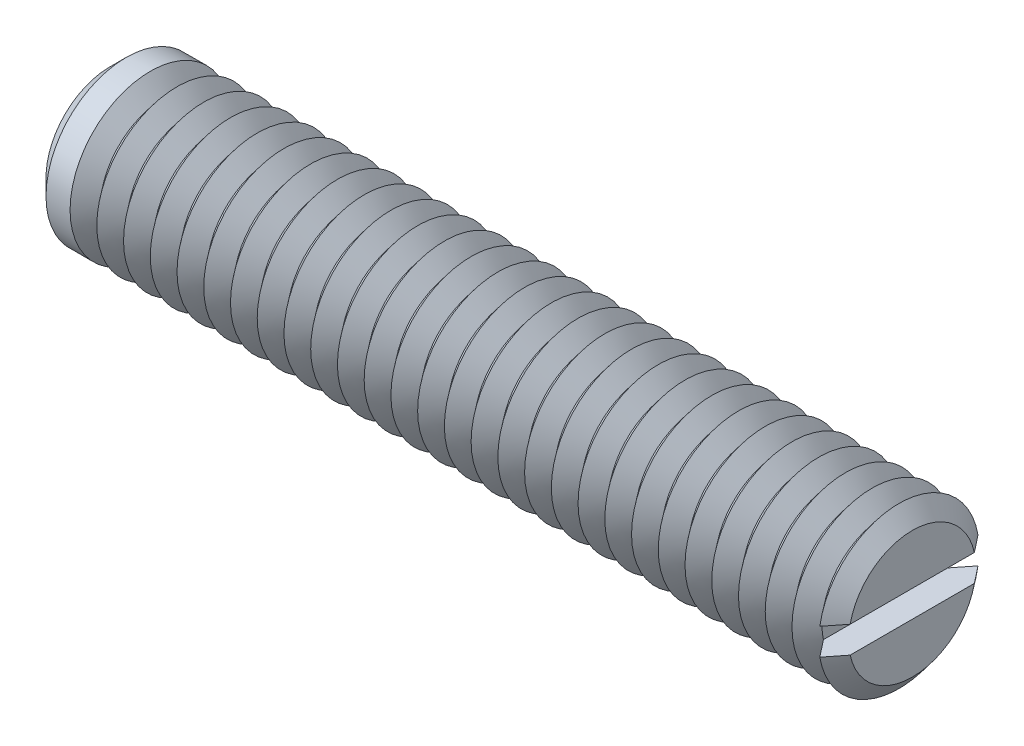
ISO-10303-21;
HEADER;
FILE_DESCRIPTION(('STEP AP214'),'2;1');
FILE_NAME('part.step','',(''),(''),'','','');
FILE_SCHEMA(('AUTOMOTIVE_DESIGN { 1 0 10303 214 1 1 1 1 }'));
ENDSEC;
DATA;
#1=APPLICATION_CONTEXT('core data for automotive mechanical design processes');
#2=APPLICATION_PROTOCOL_DEFINITION('international standard','automotive_design',2000,#1);
#3=PRODUCT_CONTEXT('',#1,'mechanical');
#4=PRODUCT('Part','Part','',(#3));
#5=PRODUCT_RELATED_PRODUCT_CATEGORY('part','',(#4));
#6=PRODUCT_DEFINITION_FORMATION('','',#4);
#7=PRODUCT_DEFINITION_CONTEXT('part definition',#1,'design');
#8=PRODUCT_DEFINITION('design','',#6,#7);
#9=PRODUCT_DEFINITION_SHAPE('','',#8);
#10=(LENGTH_UNIT() NAMED_UNIT(*) SI_UNIT(.MILLI.,.METRE.));
#11=(NAMED_UNIT(*) PLANE_ANGLE_UNIT() SI_UNIT($,.RADIAN.));
#12=(NAMED_UNIT(*) SI_UNIT($,.STERADIAN.) SOLID_ANGLE_UNIT());
#13=UNCERTAINTY_MEASURE_WITH_UNIT(LENGTH_MEASURE(1.E-05),#10,'distance_accuracy_value','');
#14=(GEOMETRIC_REPRESENTATION_CONTEXT(3) GLOBAL_UNCERTAINTY_ASSIGNED_CONTEXT((#13)) GLOBAL_UNIT_ASSIGNED_CONTEXT((#10,
#11,#12)) REPRESENTATION_CONTEXT('',''));
#15=CARTESIAN_POINT('',(0.,0.,0.));
#16=DIRECTION('',(0.,0.,1.));
#17=DIRECTION('',(1.,0.,0.));
#18=AXIS2_PLACEMENT_3D('',#15,#16,#17);
#19=CARTESIAN_POINT('',(14.5,0.,0.));
#20=DIRECTION('',(1.,0.,0.));
#21=DIRECTION('',(0.,0.,-1.));
#22=AXIS2_PLACEMENT_3D('',#19,#20,#21);
#23=CONICAL_SURFACE('',#22,3.,0.895664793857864);
#24=CARTESIAN_POINT('',(14.5,0.,0.));
#25=DIRECTION('',(-1.,0.,0.));
#26=DIRECTION('',(0.,0.,1.));
#27=AXIS2_PLACEMENT_3D('',#24,#25,#26);
#28=CIRCLE('',#27,3.);
#29=CARTESIAN_POINT('',(14.5,-0.5,-2.95803989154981));
#30=VERTEX_POINT('',#29);
#31=CARTESIAN_POINT('',(14.5,-0.5,2.95803989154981));
#32=VERTEX_POINT('',#31);
#33=EDGE_CURVE('E117',#30,#32,#28,.T.);
#34=ORIENTED_EDGE('',*,*,#33,.T.);
#35=CARTESIAN_POINT('',(17.3340158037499,-0.5,-6.52054251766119));
#36=CARTESIAN_POINT('',(17.1513674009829,-0.5,-6.29173953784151));
#37=CARTESIAN_POINT('',(16.9687482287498,-0.5,-6.06291320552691));
#38=CARTESIAN_POINT('',(16.6035782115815,-0.5,-5.60514706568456));
#39=CARTESIAN_POINT('',(16.4210273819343,-0.5,-5.37620724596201));
#40=CARTESIAN_POINT('',(16.0555297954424,-0.5,-4.91755222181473));
#41=CARTESIAN_POINT('',(15.8725834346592,-0.5,-4.68783670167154));
#42=CARTESIAN_POINT('',(15.5069310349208,-0.5,-4.22827290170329));
#43=CARTESIAN_POINT('',(15.3242249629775,-0.5,-3.99842464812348));
#44=CARTESIAN_POINT('',(14.9431833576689,-0.5,-3.51834247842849));
#45=CARTESIAN_POINT('',(14.7448786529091,-0.5,-3.26808406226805));
#46=CARTESIAN_POINT('',(14.4479597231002,-0.5,-2.89216906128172));
#47=CARTESIAN_POINT('',(14.3490516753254,-0.5,-2.7667446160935));
#48=CARTESIAN_POINT('',(14.1515374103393,-0.5,-2.51567085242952));
#49=CARTESIAN_POINT('',(14.0529311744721,-0.5,-2.39002154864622));
#50=CARTESIAN_POINT('',(13.8563868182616,-0.5,-2.13862277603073));
#51=CARTESIAN_POINT('',(13.7584477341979,-0.5,-2.01287406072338));
#52=CARTESIAN_POINT('',(13.5633111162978,-0.5,-1.76075275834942));
#53=CARTESIAN_POINT('',(13.4661137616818,-0.5,-1.63438003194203));
#54=CARTESIAN_POINT('',(13.3214734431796,-0.5,-1.44403413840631));
#55=CARTESIAN_POINT('',(13.2734745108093,-0.5,-1.38048388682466));
#56=CARTESIAN_POINT('',(13.1780284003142,-0.5,-1.25297092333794));
#57=CARTESIAN_POINT('',(13.130581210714,-0.5,-1.18900822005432));
#58=CARTESIAN_POINT('',(13.0365530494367,-0.5,-1.06048551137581));
#59=CARTESIAN_POINT('',(12.9899717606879,-0.5,-0.995925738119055));
#60=CARTESIAN_POINT('',(12.8981961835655,-0.5,-0.865829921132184));
#61=CARTESIAN_POINT('',(12.8530016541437,-0.5,-0.800294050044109));
#62=CARTESIAN_POINT('',(12.7995678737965,-0.5,-0.719528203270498));
#63=CARTESIAN_POINT('',(12.7901114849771,-0.5,-0.705104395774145));
#64=CARTESIAN_POINT('',(12.7713420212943,-0.5,-0.676163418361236));
#65=CARTESIAN_POINT('',(12.762028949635,-0.5,-0.661646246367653));
#66=CARTESIAN_POINT('',(12.7343355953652,-0.5,-0.617935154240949));
#67=CARTESIAN_POINT('',(12.7162024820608,-0.5,-0.588583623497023));
#68=CARTESIAN_POINT('',(12.6808134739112,-0.5,-0.529281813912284));
#69=CARTESIAN_POINT('',(12.6635591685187,-0.5,-0.499330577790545));
#70=CARTESIAN_POINT('',(12.630358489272,-0.5,-0.438714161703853));
#71=CARTESIAN_POINT('',(12.6144119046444,-0.5,-0.408049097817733));
#72=CARTESIAN_POINT('',(12.5785841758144,-0.5,-0.333745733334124));
#73=CARTESIAN_POINT('',(12.5595664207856,-0.5,-0.289676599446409));
#74=CARTESIAN_POINT('',(12.5278600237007,-0.5,-0.199412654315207));
#75=CARTESIAN_POINT('',(12.5151365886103,-0.5,-0.153231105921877));
#76=CARTESIAN_POINT('',(12.501111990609,-0.5,-0.068756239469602));
#77=CARTESIAN_POINT('',(12.498005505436,-0.5,-0.0307838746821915));
#78=CARTESIAN_POINT('',(12.4988722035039,-0.5,0.045057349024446));
#79=CARTESIAN_POINT('',(12.5028411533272,-0.5,0.0829262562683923));
#80=CARTESIAN_POINT('',(12.5147515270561,-0.5,0.146691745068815));
#81=CARTESIAN_POINT('',(12.5212166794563,-0.5,0.172890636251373));
#82=CARTESIAN_POINT('',(12.5365108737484,-0.5,0.224599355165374));
#83=CARTESIAN_POINT('',(12.5453416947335,-0.5,0.250108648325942));
#84=CARTESIAN_POINT('',(12.5648480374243,-0.5,0.300632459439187));
#85=CARTESIAN_POINT('',(12.5755378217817,-0.5,0.325641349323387));
#86=CARTESIAN_POINT('',(12.598235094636,-0.5,0.375035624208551));
#87=CARTESIAN_POINT('',(12.6102421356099,-0.5,0.399421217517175));
#88=CARTESIAN_POINT('',(12.650943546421,-0.5,0.478106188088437));
#89=CARTESIAN_POINT('',(12.6816009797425,-0.5,0.531380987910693));
#90=CARTESIAN_POINT('',(12.7454790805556,-0.5,0.636383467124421));
#91=CARTESIAN_POINT('',(12.7787021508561,-0.5,0.688109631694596));
#92=CARTESIAN_POINT('',(12.8467342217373,-0.5,0.790686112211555));
#93=CARTESIAN_POINT('',(12.8815468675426,-0.5,0.841534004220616));
#94=CARTESIAN_POINT('',(12.9520982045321,-0.5,0.942545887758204));
#95=CARTESIAN_POINT('',(12.987836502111,-0.5,0.992710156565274));
#96=CARTESIAN_POINT('',(13.0600131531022,-0.5,1.09268759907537));
#97=CARTESIAN_POINT('',(13.096452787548,-0.5,1.14249984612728));
#98=CARTESIAN_POINT('',(13.1697745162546,-0.5,1.24180476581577));
#99=CARTESIAN_POINT('',(13.2066566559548,-0.5,1.29129740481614));
#100=CARTESIAN_POINT('',(13.3176541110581,-0.5,1.43926830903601));
#101=CARTESIAN_POINT('',(13.3922352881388,-0.5,1.53739673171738));
#102=CARTESIAN_POINT('',(13.547080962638,-0.5,1.73962858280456));
#103=CARTESIAN_POINT('',(13.6273934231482,-0.5,1.84369513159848));
#104=CARTESIAN_POINT('',(13.7885076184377,-0.5,2.05144913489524));
#105=CARTESIAN_POINT('',(13.8693093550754,-0.5,2.15513658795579));
#106=CARTESIAN_POINT('',(14.1121843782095,-0.5,2.46584176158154));
#107=CARTESIAN_POINT('',(14.2747224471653,-0.5,2.67249578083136));
#108=CARTESIAN_POINT('',(14.6005180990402,-0.5,3.0854888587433));
#109=CARTESIAN_POINT('',(14.7637761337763,-0.5,3.29182756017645));
#110=CARTESIAN_POINT('',(15.0906371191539,-0.5,3.70422676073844));
#111=CARTESIAN_POINT('',(15.2542400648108,-0.5,3.91028726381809));
#112=CARTESIAN_POINT('',(15.5774242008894,-0.5,4.31690950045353));
#113=CARTESIAN_POINT('',(15.7369999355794,-0.5,4.51747557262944));
#114=CARTESIAN_POINT('',(16.0562886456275,-0.5,4.91850000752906));
#115=CARTESIAN_POINT('',(16.216001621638,-0.5,5.11895836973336));
#116=CARTESIAN_POINT('',(16.5353926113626,-0.5,5.51963619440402));
#117=CARTESIAN_POINT('',(16.6950705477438,-0.5,5.71985571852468));
#118=CARTESIAN_POINT('',(17.0144964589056,-0.5,6.12023723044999));
#119=CARTESIAN_POINT('',(17.1742444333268,-0.5,6.32039921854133));
#120=CARTESIAN_POINT('',(17.3340158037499,-0.5,6.52054251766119));
#121=B_SPLINE_CURVE_WITH_KNOTS('',3,(#35,#36,#37,#38,#39,#40,#41,#42,#43,#44,#45,#46,#47,#48,
#49,#50,#51,#52,#53,#54,#55,#56,#57,#58,#59,#60,#61,#62,#63,#64,#65,#66,#67,#68,#69,#70,#71,#72,
#73,#74,#75,#76,#77,#78,#79,#80,#81,#82,#83,#84,#85,#86,#87,#88,#89,#90,#91,#92,#93,#94,#95,#96,
#97,#98,#99,#100,#101,#102,#103,#104,#105,#106,#107,#108,#109,#110,#111,#112,#113,#114,#115,
#116,#117,#118,#119,#120),.UNSPECIFIED.,.F.,.F.,(4,2,2,2,2,2,2,2,2,2,2,2,2,2,2,2,2,2,2,2,2,2,2,
2,2,2,2,2,2,2,2,2,2,2,2,2,2,2,2,2,2,2,4),(0.,0.87829449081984,1.7567272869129,2.63771941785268,
3.51857435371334,4.47648054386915,4.95567426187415,5.43483773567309,5.91300334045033,
6.39128103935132,6.63019943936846,6.86911286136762,7.10793700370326,7.34671939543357,
7.39846053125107,7.45020282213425,7.55369448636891,7.65736712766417,7.7610230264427,
7.90476612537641,8.04770552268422,8.16137782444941,8.27498213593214,8.35581399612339,
8.43670681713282,8.51825011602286,8.59976579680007,8.78399479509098,8.96839847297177,
9.15324864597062,9.3380214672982,9.52317177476,9.70834126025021,10.0780963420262,
10.472454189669,10.8668135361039,11.65555692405,12.4448978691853,13.2342274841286,
14.0031360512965,14.7720482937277,15.5403347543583,16.3086173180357),.UNSPECIFIED.);
#122=CARTESIAN_POINT('',(14.,-0.5,2.32228361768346));
#123=VERTEX_POINT('',#122);
#124=EDGE_CURVE('E109',#123,#32,#121,.T.);
#125=ORIENTED_EDGE('',*,*,#124,.F.);
#126=CARTESIAN_POINT('',(14.,0.,0.));
#127=DIRECTION('',(-1.,0.,0.));
#128=DIRECTION('',(0.,0.,1.));
#129=AXIS2_PLACEMENT_3D('',#126,#127,#128);
#130=CIRCLE('',#129,2.37550020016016);
#131=CARTESIAN_POINT('',(14.,-0.5,-2.32228361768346));
#132=VERTEX_POINT('',#131);
#133=EDGE_CURVE('E448',#132,#123,#130,.T.);
#134=ORIENTED_EDGE('',*,*,#133,.F.);
#135=EDGE_CURVE('E58',#30,#132,#121,.T.);
#136=ORIENTED_EDGE('',*,*,#135,.F.);
#137=EDGE_LOOP('',(#34,#125,#134,#136));
#138=FACE_BOUND('',#137,.T.);
#139=ADVANCED_FACE('F37',(#138),#23,.T.);
#140=CARTESIAN_POINT('',(14.5,0.5,2.95803989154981));
#141=VERTEX_POINT('',#140);
#142=CARTESIAN_POINT('',(14.5,0.499999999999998,-2.95803989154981));
#143=VERTEX_POINT('',#142);
#144=EDGE_CURVE('E100',#141,#143,#28,.T.);
#145=ORIENTED_EDGE('',*,*,#144,.T.);
#146=CARTESIAN_POINT('',(17.3340158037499,0.5,6.52054251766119));
#147=CARTESIAN_POINT('',(17.1513674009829,0.5,6.29173953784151));
#148=CARTESIAN_POINT('',(16.9687482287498,0.5,6.06291320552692));
#149=CARTESIAN_POINT('',(16.6035782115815,0.5,5.60514706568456));
#150=CARTESIAN_POINT('',(16.4210273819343,0.5,5.37620724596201));
#151=CARTESIAN_POINT('',(16.0555297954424,0.5,4.91755222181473));
#152=CARTESIAN_POINT('',(15.8725834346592,0.5,4.68783670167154));
#153=CARTESIAN_POINT('',(15.5069310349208,0.5,4.22827290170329));
#154=CARTESIAN_POINT('',(15.3242249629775,0.5,3.99842464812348));
#155=CARTESIAN_POINT('',(14.9431833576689,0.5,3.5183424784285));
#156=CARTESIAN_POINT('',(14.7448786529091,0.5,3.26808406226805));
#157=CARTESIAN_POINT('',(14.4479597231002,0.5,2.89216906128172));
#158=CARTESIAN_POINT('',(14.3490516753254,0.5,2.7667446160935));
#159=CARTESIAN_POINT('',(14.1515374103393,0.5,2.51567085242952));
#160=CARTESIAN_POINT('',(14.0529311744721,0.5,2.39002154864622));
#161=CARTESIAN_POINT('',(13.8563868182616,0.5,2.13862277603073));
#162=CARTESIAN_POINT('',(13.7584477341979,0.5,2.01287406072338));
#163=CARTESIAN_POINT('',(13.5633111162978,0.5,1.76075275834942));
#164=CARTESIAN_POINT('',(13.4661137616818,0.5,1.63438003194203));
#165=CARTESIAN_POINT('',(13.3214734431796,0.5,1.44403413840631));
#166=CARTESIAN_POINT('',(13.2734745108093,0.5,1.38048388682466));
#167=CARTESIAN_POINT('',(13.1780284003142,0.5,1.25297092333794));
#168=CARTESIAN_POINT('',(13.130581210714,0.5,1.18900822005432));
#169=CARTESIAN_POINT('',(13.0365530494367,0.5,1.06048551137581));
#170=CARTESIAN_POINT('',(12.9899717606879,0.5,0.995925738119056));
#171=CARTESIAN_POINT('',(12.8981961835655,0.5,0.865829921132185));
#172=CARTESIAN_POINT('',(12.8530016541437,0.5,0.80029405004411));
#173=CARTESIAN_POINT('',(12.7995678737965,0.5,0.719528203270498));
#174=CARTESIAN_POINT('',(12.7901114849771,0.5,0.705104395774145));
#175=CARTESIAN_POINT('',(12.7713420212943,0.5,0.676163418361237));
#176=CARTESIAN_POINT('',(12.762028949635,0.5,0.661646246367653));
#177=CARTESIAN_POINT('',(12.7343355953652,0.5,0.61793515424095));
#178=CARTESIAN_POINT('',(12.7162024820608,0.5,0.588583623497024));
#179=CARTESIAN_POINT('',(12.6808134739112,0.5,0.529281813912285));
#180=CARTESIAN_POINT('',(12.6635591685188,0.5,0.499330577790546));
#181=CARTESIAN_POINT('',(12.630358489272,0.5,0.438714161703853));
#182=CARTESIAN_POINT('',(12.6144119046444,0.5,0.408049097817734));
#183=CARTESIAN_POINT('',(12.5785841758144,0.5,0.333745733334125));
#184=CARTESIAN_POINT('',(12.5595664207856,0.5,0.289676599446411));
#185=CARTESIAN_POINT('',(12.5278600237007,0.5,0.199412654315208));
#186=CARTESIAN_POINT('',(12.5151365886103,0.5,0.153231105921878));
#187=CARTESIAN_POINT('',(12.501111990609,0.5,0.068756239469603));
#188=CARTESIAN_POINT('',(12.498005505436,0.5,0.030783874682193));
#189=CARTESIAN_POINT('',(12.4988722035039,0.5,-0.0450573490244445));
#190=CARTESIAN_POINT('',(12.5028411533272,0.5,-0.0829262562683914));
#191=CARTESIAN_POINT('',(12.5147515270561,0.5,-0.146691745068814));
#192=CARTESIAN_POINT('',(12.5212166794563,0.5,-0.172890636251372));
#193=CARTESIAN_POINT('',(12.5365108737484,0.5,-0.224599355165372));
#194=CARTESIAN_POINT('',(12.5453416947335,0.5,-0.25010864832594));
#195=CARTESIAN_POINT('',(12.5648480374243,0.5,-0.300632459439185));
#196=CARTESIAN_POINT('',(12.5755378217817,0.5,-0.325641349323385));
#197=CARTESIAN_POINT('',(12.598235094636,0.5,-0.375035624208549));
#198=CARTESIAN_POINT('',(12.6102421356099,0.5,-0.399421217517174));
#199=CARTESIAN_POINT('',(12.650943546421,0.5,-0.478106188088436));
#200=CARTESIAN_POINT('',(12.6816009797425,0.5,-0.531380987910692));
#201=CARTESIAN_POINT('',(12.7454790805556,0.5,-0.63638346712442));
#202=CARTESIAN_POINT('',(12.7787021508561,0.5,-0.688109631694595));
#203=CARTESIAN_POINT('',(12.8467342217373,0.5,-0.790686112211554));
#204=CARTESIAN_POINT('',(12.8815468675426,0.5,-0.841534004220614));
#205=CARTESIAN_POINT('',(12.9520982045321,0.5,-0.942545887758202));
#206=CARTESIAN_POINT('',(12.987836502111,0.5,-0.992710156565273));
#207=CARTESIAN_POINT('',(13.0600131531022,0.5,-1.09268759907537));
#208=CARTESIAN_POINT('',(13.096452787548,0.5,-1.14249984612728));
#209=CARTESIAN_POINT('',(13.1697745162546,0.5,-1.24180476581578));
#210=CARTESIAN_POINT('',(13.2066566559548,0.5,-1.29129740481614));
#211=CARTESIAN_POINT('',(13.3176541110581,0.5,-1.43926830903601));
#212=CARTESIAN_POINT('',(13.3922352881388,0.5,-1.53739673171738));
#213=CARTESIAN_POINT('',(13.547080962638,0.5,-1.73962858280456));
#214=CARTESIAN_POINT('',(13.6273934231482,0.5,-1.84369513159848));
#215=CARTESIAN_POINT('',(13.7885076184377,0.5,-2.05144913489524));
#216=CARTESIAN_POINT('',(13.8693093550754,0.5,-2.15513658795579));
#217=CARTESIAN_POINT('',(14.1121843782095,0.5,-2.46584176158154));
#218=CARTESIAN_POINT('',(14.2747224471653,0.5,-2.67249578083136));
#219=CARTESIAN_POINT('',(14.6005180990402,0.5,-3.0854888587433));
#220=CARTESIAN_POINT('',(14.7637761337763,0.5,-3.29182756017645));
#221=CARTESIAN_POINT('',(15.0906371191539,0.5,-3.70422676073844));
#222=CARTESIAN_POINT('',(15.2542400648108,0.5,-3.91028726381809));
#223=CARTESIAN_POINT('',(15.5774242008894,0.5,-4.31690950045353));
#224=CARTESIAN_POINT('',(15.7369999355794,0.5,-4.51747557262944));
#225=CARTESIAN_POINT('',(16.0562886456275,0.5,-4.91850000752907));
#226=CARTESIAN_POINT('',(16.216001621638,0.5,-5.11895836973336));
#227=CARTESIAN_POINT('',(16.5353926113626,0.5,-5.51963619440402));
#228=CARTESIAN_POINT('',(16.6950705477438,0.5,-5.71985571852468));
#229=CARTESIAN_POINT('',(17.0144964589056,0.5,-6.12023723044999));
#230=CARTESIAN_POINT('',(17.1742444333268,0.5,-6.32039921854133));
#231=CARTESIAN_POINT('',(17.3340158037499,0.5,-6.52054251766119));
#232=B_SPLINE_CURVE_WITH_KNOTS('',3,(#146,#147,#148,#149,#150,#151,#152,#153,#154,#155,#156,
#157,#158,#159,#160,#161,#162,#163,#164,#165,#166,#167,#168,#169,#170,#171,#172,#173,#174,#175,
#176,#177,#178,#179,#180,#181,#182,#183,#184,#185,#186,#187,#188,#189,#190,#191,#192,#193,#194,
#195,#196,#197,#198,#199,#200,#201,#202,#203,#204,#205,#206,#207,#208,#209,#210,#211,#212,#213,
#214,#215,#216,#217,#218,#219,#220,#221,#222,#223,#224,#225,#226,#227,#228,#229,#230,#231),
.UNSPECIFIED.,.F.,.F.,(4,2,2,2,2,2,2,2,2,2,2,2,2,2,2,2,2,2,2,2,2,2,2,2,2,2,2,2,2,2,2,2,2,2,2,2,
2,2,2,2,2,2,4),(0.,0.87829449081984,1.7567272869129,2.63771941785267,3.51857435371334,
4.47648054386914,4.95567426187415,5.43483773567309,5.91300334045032,6.39128103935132,
6.63019943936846,6.86911286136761,7.10793700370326,7.34671939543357,7.39846053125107,
7.45020282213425,7.55369448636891,7.65736712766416,7.76102302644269,7.90476612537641,
8.04770552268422,8.16137782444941,8.27498213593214,8.35581399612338,8.43670681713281,
8.51825011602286,8.59976579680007,8.78399479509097,8.96839847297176,9.15324864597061,
9.3380214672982,9.52317177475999,9.70834126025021,10.0780963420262,10.472454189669,
10.8668135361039,11.65555692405,12.4448978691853,13.2342274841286,14.0031360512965,
14.7720482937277,15.5403347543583,16.3086173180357),.UNSPECIFIED.);
#233=CARTESIAN_POINT('',(14.,0.5,-2.32228361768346));
#234=VERTEX_POINT('',#233);
#235=EDGE_CURVE('E110',#234,#143,#232,.T.);
#236=ORIENTED_EDGE('',*,*,#235,.F.);
#237=CARTESIAN_POINT('',(14.,0.5,2.32228361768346));
#238=VERTEX_POINT('',#237);
#239=EDGE_CURVE('E103',#238,#234,#130,.T.);
#240=ORIENTED_EDGE('',*,*,#239,.F.);
#241=EDGE_CURVE('E97',#141,#238,#232,.T.);
#242=ORIENTED_EDGE('',*,*,#241,.F.);
#243=EDGE_LOOP('',(#145,#236,#240,#242));
#244=FACE_BOUND('',#243,.T.);
#245=ADVANCED_FACE('F99',(#244),#23,.T.);
#246=CARTESIAN_POINT('',(14.,0.,0.));
#247=DIRECTION('',(-1.,0.,0.));
#248=DIRECTION('',(0.,0.,1.));
#249=AXIS2_PLACEMENT_3D('',#246,#247,#248);
#250=CONICAL_SURFACE('',#249,2.37550020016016,0.895664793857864);
#251=CARTESIAN_POINT('',(13.5,0.,0.));
#252=DIRECTION('',(-1.,0.,0.));
#253=DIRECTION('',(0.,0.,1.));
#254=AXIS2_PLACEMENT_3D('',#251,#252,#253);
#255=CIRCLE('',#254,3.);
#256=CARTESIAN_POINT('',(13.5,0.,3.));
#257=VERTEX_POINT('',#256);
#258=EDGE_CURVE('E435',#257,#257,#255,.T.);
#259=ORIENTED_EDGE('',*,*,#258,.F.);
#260=EDGE_LOOP('',(#259));
#261=FACE_BOUND('',#260,.T.);
#262=ORIENTED_EDGE('',*,*,#239,.T.);
#263=EDGE_CURVE('E443',#234,#132,#130,.T.);
#264=ORIENTED_EDGE('',*,*,#263,.T.);
#265=ORIENTED_EDGE('',*,*,#133,.T.);
#266=EDGE_CURVE('E441',#123,#238,#130,.T.);
#267=ORIENTED_EDGE('',*,*,#266,.T.);
#268=EDGE_LOOP('',(#262,#264,#265,#267));
#269=FACE_BOUND('',#268,.T.);
#270=ADVANCED_FACE('F167',(#261,#269),#250,.T.);
#271=CARTESIAN_POINT('',(15.,0.,0.));
#272=DIRECTION('',(1.,0.,0.));
#273=DIRECTION('',(0.,0.,-1.));
#274=AXIS2_PLACEMENT_3D('',#271,#272,#273);
#275=PLANE('',#274);
#276=CARTESIAN_POINT('',(15.,0.,0.));
#277=DIRECTION('',(-1.,0.,0.));
#278=DIRECTION('',(0.,0.,1.));
#279=AXIS2_PLACEMENT_3D('',#276,#277,#278);
#280=CIRCLE('',#279,2.37550020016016);
#281=CARTESIAN_POINT('',(15.,0.5,2.32228361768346));
#282=VERTEX_POINT('',#281);
#283=CARTESIAN_POINT('',(15.,0.5,-2.32228361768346));
#284=VERTEX_POINT('',#283);
#285=EDGE_CURVE('E159',#282,#284,#280,.T.);
#286=ORIENTED_EDGE('',*,*,#285,.F.);
#287=DIRECTION('',(0.,0.,1.));
#288=VECTOR('',#287,1.);
#289=CARTESIAN_POINT('',(15.,0.5,0.));
#290=LINE('',#289,#288);
#291=EDGE_CURVE('E122',#284,#282,#290,.T.);
#292=ORIENTED_EDGE('',*,*,#291,.F.);
#293=EDGE_LOOP('',(#286,#292));
#294=FACE_BOUND('',#293,.T.);
#295=ADVANCED_FACE('F171',(#294),#275,.T.);
#296=CARTESIAN_POINT('',(15.,-0.5,-2.32228361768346));
#297=VERTEX_POINT('',#296);
#298=CARTESIAN_POINT('',(15.,-0.5,2.32228361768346));
#299=VERTEX_POINT('',#298);
#300=EDGE_CURVE('E66',#297,#299,#280,.T.);
#301=ORIENTED_EDGE('',*,*,#300,.F.);
#302=DIRECTION('',(0.,0.,-1.));
#303=VECTOR('',#302,1.);
#304=CARTESIAN_POINT('',(15.,-0.5,0.));
#305=LINE('',#304,#303);
#306=EDGE_CURVE('E135',#299,#297,#305,.T.);
#307=ORIENTED_EDGE('',*,*,#306,.F.);
#308=EDGE_LOOP('',(#301,#307));
#309=FACE_BOUND('',#308,.T.);
#310=ADVANCED_FACE('F201',(#309),#275,.T.);
#311=CARTESIAN_POINT('',(15.,0.,0.));
#312=DIRECTION('',(-1.,0.,0.));
#313=DIRECTION('',(0.,0.,1.));
#314=AXIS2_PLACEMENT_3D('',#311,#312,#313);
#315=CONICAL_SURFACE('',#314,2.37550020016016,0.895664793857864);
#316=ORIENTED_EDGE('',*,*,#144,.F.);
#317=CARTESIAN_POINT('',(11.6659841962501,0.5,-6.52054251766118));
#318=CARTESIAN_POINT('',(11.8486325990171,0.5,-6.29173953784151));
#319=CARTESIAN_POINT('',(12.0312517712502,0.5,-6.0629132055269));
#320=CARTESIAN_POINT('',(12.3964217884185,0.5,-5.60514706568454));
#321=CARTESIAN_POINT('',(12.5789726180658,0.5,-5.37620724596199));
#322=CARTESIAN_POINT('',(12.9444702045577,0.5,-4.91755222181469));
#323=CARTESIAN_POINT('',(13.1274165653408,0.5,-4.6878367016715));
#324=CARTESIAN_POINT('',(13.4930689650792,0.5,-4.22827290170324));
#325=CARTESIAN_POINT('',(13.6757750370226,0.5,-3.99842464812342));
#326=CARTESIAN_POINT('',(14.0568166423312,0.5,-3.51834247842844));
#327=CARTESIAN_POINT('',(14.255121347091,0.5,-3.268084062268));
#328=CARTESIAN_POINT('',(14.5520402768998,0.5,-2.89216906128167));
#329=CARTESIAN_POINT('',(14.6509483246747,0.5,-2.76674461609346));
#330=CARTESIAN_POINT('',(14.8484625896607,0.5,-2.51567085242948));
#331=CARTESIAN_POINT('',(14.9470688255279,0.5,-2.39002154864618));
#332=CARTESIAN_POINT('',(15.1436131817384,0.5,-2.1386227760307));
#333=CARTESIAN_POINT('',(15.2415522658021,0.5,-2.01287406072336));
#334=CARTESIAN_POINT('',(15.4366888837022,0.5,-1.7607527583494));
#335=CARTESIAN_POINT('',(15.5338862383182,0.5,-1.63438003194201));
#336=CARTESIAN_POINT('',(15.6785265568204,0.5,-1.44403413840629));
#337=CARTESIAN_POINT('',(15.7265254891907,0.5,-1.38048388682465));
#338=CARTESIAN_POINT('',(15.8219715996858,0.5,-1.25297092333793));
#339=CARTESIAN_POINT('',(15.869418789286,0.5,-1.18900822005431));
#340=CARTESIAN_POINT('',(15.9634469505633,0.5,-1.0604855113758));
#341=CARTESIAN_POINT('',(16.0100282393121,0.5,-0.995925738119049));
#342=CARTESIAN_POINT('',(16.1018038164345,0.5,-0.865829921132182));
#343=CARTESIAN_POINT('',(16.1469983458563,0.5,-0.800294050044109));
#344=CARTESIAN_POINT('',(16.2004321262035,0.5,-0.719528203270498));
#345=CARTESIAN_POINT('',(16.2098885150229,0.5,-0.705104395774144));
#346=CARTESIAN_POINT('',(16.2286579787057,0.5,-0.676163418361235));
#347=CARTESIAN_POINT('',(16.237971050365,0.5,-0.661646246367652));
#348=CARTESIAN_POINT('',(16.2656644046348,0.5,-0.617935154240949));
#349=CARTESIAN_POINT('',(16.2837975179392,0.5,-0.588583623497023));
#350=CARTESIAN_POINT('',(16.3191865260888,0.5,-0.529281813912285));
#351=CARTESIAN_POINT('',(16.3364408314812,0.5,-0.499330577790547));
#352=CARTESIAN_POINT('',(16.369641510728,0.5,-0.438714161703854));
#353=CARTESIAN_POINT('',(16.3855880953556,0.5,-0.408049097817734));
#354=CARTESIAN_POINT('',(16.4214158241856,0.5,-0.333745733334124));
#355=CARTESIAN_POINT('',(16.4404335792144,0.5,-0.289676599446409));
#356=CARTESIAN_POINT('',(16.4721399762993,0.5,-0.199412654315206));
#357=CARTESIAN_POINT('',(16.4848634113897,0.5,-0.153231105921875));
#358=CARTESIAN_POINT('',(16.498888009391,0.5,-0.0687562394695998));
#359=CARTESIAN_POINT('',(16.501994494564,0.5,-0.030783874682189));
#360=CARTESIAN_POINT('',(16.5011277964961,0.5,0.0450573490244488));
#361=CARTESIAN_POINT('',(16.4971588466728,0.5,0.0829262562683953));
#362=CARTESIAN_POINT('',(16.4852484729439,0.5,0.146691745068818));
#363=CARTESIAN_POINT('',(16.4787833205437,0.5,0.172890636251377));
#364=CARTESIAN_POINT('',(16.4634891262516,0.5,0.224599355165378));
#365=CARTESIAN_POINT('',(16.4546583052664,0.5,0.250108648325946));
#366=CARTESIAN_POINT('',(16.4351519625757,0.5,0.300632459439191));
#367=CARTESIAN_POINT('',(16.4244621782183,0.5,0.325641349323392));
#368=CARTESIAN_POINT('',(16.401764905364,0.5,0.375035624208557));
#369=CARTESIAN_POINT('',(16.3897578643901,0.5,0.399421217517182));
#370=CARTESIAN_POINT('',(16.3490564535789,0.5,0.478106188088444));
#371=CARTESIAN_POINT('',(16.3183990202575,0.5,0.531380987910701));
#372=CARTESIAN_POINT('',(16.2545209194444,0.5,0.63638346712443));
#373=CARTESIAN_POINT('',(16.2212978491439,0.5,0.688109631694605));
#374=CARTESIAN_POINT('',(16.1532657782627,0.5,0.790686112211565));
#375=CARTESIAN_POINT('',(16.1184531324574,0.5,0.841534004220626));
#376=CARTESIAN_POINT('',(16.0479017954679,0.5,0.942545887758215));
#377=CARTESIAN_POINT('',(16.0121634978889,0.5,0.992710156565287));
#378=CARTESIAN_POINT('',(15.9399868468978,0.5,1.09268759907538));
#379=CARTESIAN_POINT('',(15.903547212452,0.5,1.14249984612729));
#380=CARTESIAN_POINT('',(15.8302254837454,0.5,1.24180476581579));
#381=CARTESIAN_POINT('',(15.7933433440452,0.5,1.29129740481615));
#382=CARTESIAN_POINT('',(15.6823458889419,0.5,1.43926830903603));
#383=CARTESIAN_POINT('',(15.6077647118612,0.5,1.5373967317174));
#384=CARTESIAN_POINT('',(15.452919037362,0.5,1.73962858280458));
#385=CARTESIAN_POINT('',(15.3726065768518,0.5,1.8436951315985));
#386=CARTESIAN_POINT('',(15.2114923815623,0.5,2.05144913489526));
#387=CARTESIAN_POINT('',(15.1306906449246,0.5,2.15513658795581));
#388=CARTESIAN_POINT('',(14.8878156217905,0.5,2.46584176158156));
#389=CARTESIAN_POINT('',(14.7252775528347,0.5,2.67249578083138));
#390=CARTESIAN_POINT('',(14.3994819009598,0.5,3.08548885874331));
#391=CARTESIAN_POINT('',(14.2362238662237,0.5,3.29182756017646));
#392=CARTESIAN_POINT('',(13.9093628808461,0.5,3.70422676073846));
#393=CARTESIAN_POINT('',(13.7457599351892,0.5,3.9102872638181));
#394=CARTESIAN_POINT('',(13.4225757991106,0.5,4.31690950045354));
#395=CARTESIAN_POINT('',(13.2630000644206,0.5,4.51747557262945));
#396=CARTESIAN_POINT('',(12.9437113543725,0.5,4.91850000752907));
#397=CARTESIAN_POINT('',(12.7839983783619,0.5,5.11895836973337));
#398=CARTESIAN_POINT('',(12.4646073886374,0.5,5.51963619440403));
#399=CARTESIAN_POINT('',(12.3049294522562,0.5,5.71985571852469));
#400=CARTESIAN_POINT('',(11.9855035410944,0.5,6.12023723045));
#401=CARTESIAN_POINT('',(11.8257555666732,0.5,6.32039921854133));
#402=CARTESIAN_POINT('',(11.6659841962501,0.5,6.52054251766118));
#403=B_SPLINE_CURVE_WITH_KNOTS('',3,(#317,#318,#319,#320,#321,#322,#323,#324,#325,#326,#327,
#328,#329,#330,#331,#332,#333,#334,#335,#336,#337,#338,#339,#340,#341,#342,#343,#344,#345,#346,
#347,#348,#349,#350,#351,#352,#353,#354,#355,#356,#357,#358,#359,#360,#361,#362,#363,#364,#365,
#366,#367,#368,#369,#370,#371,#372,#373,#374,#375,#376,#377,#378,#379,#380,#381,#382,#383,#384,
#385,#386,#387,#388,#389,#390,#391,#392,#393,#394,#395,#396,#397,#398,#399,#400,#401,#402),
.UNSPECIFIED.,.F.,.F.,(4,2,2,2,2,2,2,2,2,2,2,2,2,2,2,2,2,2,2,2,2,2,2,2,2,2,2,2,2,2,2,2,2,2,2,2,
2,2,2,2,2,2,4),(0.,0.878294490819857,1.75672728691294,2.63771941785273,3.51857435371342,
4.4764805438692,4.9556742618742,5.43483773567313,5.91300334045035,6.39128103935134,
6.63019943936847,6.86911286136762,7.10793700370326,7.34671939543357,7.39846053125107,
7.45020282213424,7.5536944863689,7.65736712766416,7.76102302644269,7.90476612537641,
8.04770552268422,8.16137782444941,8.27498213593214,8.35581399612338,8.43670681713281,
8.51825011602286,8.59976579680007,8.78399479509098,8.96839847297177,9.15324864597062,
9.33802146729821,9.52317177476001,9.70834126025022,10.0780963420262,10.472454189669,
10.8668135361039,11.65555692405,12.4448978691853,13.2342274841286,14.0031360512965,
14.7720482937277,15.5403347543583,16.3086173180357),.UNSPECIFIED.);
#404=EDGE_CURVE('E41',#282,#141,#403,.T.);
#405=ORIENTED_EDGE('',*,*,#404,.F.);
#406=ORIENTED_EDGE('',*,*,#285,.T.);
#407=EDGE_CURVE('E11',#143,#284,#403,.T.);
#408=ORIENTED_EDGE('',*,*,#407,.F.);
#409=EDGE_LOOP('',(#316,#405,#406,#408));
#410=FACE_BOUND('',#409,.T.);
#411=ADVANCED_FACE('F114',(#410),#315,.T.);
#412=CARTESIAN_POINT('',(15.,0.5,-4.5));
#413=DIRECTION('',(0.,1.,0.));
#414=DIRECTION('',(-1.,0.,0.));
#415=AXIS2_PLACEMENT_3D('',#412,#413,#414);
#416=PLANE('',#415);
#417=ORIENTED_EDGE('',*,*,#404,.T.);
#418=ORIENTED_EDGE('',*,*,#241,.T.);
#419=DIRECTION('',(0.,0.,1.));
#420=VECTOR('',#419,1.);
#421=CARTESIAN_POINT('',(14.,0.5,-4.5));
#422=LINE('',#421,#420);
#423=EDGE_CURVE('E144',#234,#238,#422,.T.);
#424=ORIENTED_EDGE('',*,*,#423,.F.);
#425=ORIENTED_EDGE('',*,*,#235,.T.);
#426=ORIENTED_EDGE('',*,*,#407,.T.);
#427=ORIENTED_EDGE('',*,*,#291,.T.);
#428=EDGE_LOOP('',(#417,#418,#424,#425,#426,#427));
#429=FACE_BOUND('',#428,.T.);
#430=ADVANCED_FACE('F120',(#429),#416,.F.);
#431=ORIENTED_EDGE('',*,*,#33,.F.);
#432=CARTESIAN_POINT('',(11.6659841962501,-0.5,6.52054251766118));
#433=CARTESIAN_POINT('',(11.8486325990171,-0.5,6.29173953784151));
#434=CARTESIAN_POINT('',(12.0312517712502,-0.5,6.0629132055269));
#435=CARTESIAN_POINT('',(12.3964217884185,-0.5,5.60514706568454));
#436=CARTESIAN_POINT('',(12.5789726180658,-0.5,5.37620724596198));
#437=CARTESIAN_POINT('',(12.9444702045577,-0.5,4.91755222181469));
#438=CARTESIAN_POINT('',(13.1274165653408,-0.5,4.6878367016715));
#439=CARTESIAN_POINT('',(13.4930689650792,-0.5,4.22827290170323));
#440=CARTESIAN_POINT('',(13.6757750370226,-0.5,3.99842464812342));
#441=CARTESIAN_POINT('',(14.0568166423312,-0.5,3.51834247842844));
#442=CARTESIAN_POINT('',(14.255121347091,-0.5,3.268084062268));
#443=CARTESIAN_POINT('',(14.5520402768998,-0.5,2.89216906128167));
#444=CARTESIAN_POINT('',(14.6509483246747,-0.5,2.76674461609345));
#445=CARTESIAN_POINT('',(14.8484625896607,-0.5,2.51567085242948));
#446=CARTESIAN_POINT('',(14.9470688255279,-0.5,2.39002154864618));
#447=CARTESIAN_POINT('',(15.1436131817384,-0.5,2.1386227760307));
#448=CARTESIAN_POINT('',(15.2415522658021,-0.5,2.01287406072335));
#449=CARTESIAN_POINT('',(15.4366888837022,-0.5,1.7607527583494));
#450=CARTESIAN_POINT('',(15.5338862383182,-0.5,1.63438003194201));
#451=CARTESIAN_POINT('',(15.6785265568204,-0.5,1.44403413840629));
#452=CARTESIAN_POINT('',(15.7265254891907,-0.5,1.38048388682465));
#453=CARTESIAN_POINT('',(15.8219715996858,-0.5,1.25297092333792));
#454=CARTESIAN_POINT('',(15.869418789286,-0.5,1.18900822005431));
#455=CARTESIAN_POINT('',(15.9634469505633,-0.5,1.0604855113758));
#456=CARTESIAN_POINT('',(16.0100282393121,-0.5,0.995925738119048));
#457=CARTESIAN_POINT('',(16.1018038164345,-0.5,0.865829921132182));
#458=CARTESIAN_POINT('',(16.1469983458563,-0.5,0.800294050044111));
#459=CARTESIAN_POINT('',(16.2004321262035,-0.5,0.719528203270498));
#460=CARTESIAN_POINT('',(16.2098885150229,-0.5,0.705104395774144));
#461=CARTESIAN_POINT('',(16.2286579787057,-0.5,0.676163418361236));
#462=CARTESIAN_POINT('',(16.237971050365,-0.5,0.661646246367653));
#463=CARTESIAN_POINT('',(16.2656644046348,-0.5,0.61793515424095));
#464=CARTESIAN_POINT('',(16.2837975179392,-0.5,0.588583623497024));
#465=CARTESIAN_POINT('',(16.3191865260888,-0.5,0.529281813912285));
#466=CARTESIAN_POINT('',(16.3364408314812,-0.5,0.499330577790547));
#467=CARTESIAN_POINT('',(16.369641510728,-0.5,0.438714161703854));
#468=CARTESIAN_POINT('',(16.3855880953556,-0.5,0.408049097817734));
#469=CARTESIAN_POINT('',(16.4214158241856,-0.5,0.333745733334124));
#470=CARTESIAN_POINT('',(16.4404335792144,-0.5,0.28967659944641));
#471=CARTESIAN_POINT('',(16.4721399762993,-0.5,0.199412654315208));
#472=CARTESIAN_POINT('',(16.4848634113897,-0.5,0.153231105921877));
#473=CARTESIAN_POINT('',(16.498888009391,-0.5,0.0687562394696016));
#474=CARTESIAN_POINT('',(16.501994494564,-0.5,0.0307838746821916));
#475=CARTESIAN_POINT('',(16.5011277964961,-0.5,-0.0450573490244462));
#476=CARTESIAN_POINT('',(16.4971588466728,-0.5,-0.0829262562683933));
#477=CARTESIAN_POINT('',(16.4852484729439,-0.5,-0.146691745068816));
#478=CARTESIAN_POINT('',(16.4787833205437,-0.5,-0.172890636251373));
#479=CARTESIAN_POINT('',(16.4634891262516,-0.5,-0.224599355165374));
#480=CARTESIAN_POINT('',(16.4546583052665,-0.5,-0.250108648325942));
#481=CARTESIAN_POINT('',(16.4351519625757,-0.5,-0.300632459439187));
#482=CARTESIAN_POINT('',(16.4244621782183,-0.5,-0.325641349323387));
#483=CARTESIAN_POINT('',(16.401764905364,-0.5,-0.375035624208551));
#484=CARTESIAN_POINT('',(16.3897578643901,-0.5,-0.399421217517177));
#485=CARTESIAN_POINT('',(16.3490564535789,-0.5,-0.47810618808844));
#486=CARTESIAN_POINT('',(16.3183990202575,-0.5,-0.531380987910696));
#487=CARTESIAN_POINT('',(16.2545209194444,-0.5,-0.636383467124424));
#488=CARTESIAN_POINT('',(16.2212978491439,-0.5,-0.688109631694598));
#489=CARTESIAN_POINT('',(16.1532657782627,-0.5,-0.790686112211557));
#490=CARTESIAN_POINT('',(16.1184531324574,-0.5,-0.841534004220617));
#491=CARTESIAN_POINT('',(16.0479017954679,-0.5,-0.942545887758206));
#492=CARTESIAN_POINT('',(16.0121634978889,-0.5,-0.992710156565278));
#493=CARTESIAN_POINT('',(15.9399868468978,-0.5,-1.09268759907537));
#494=CARTESIAN_POINT('',(15.903547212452,-0.5,-1.14249984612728));
#495=CARTESIAN_POINT('',(15.8302254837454,-0.5,-1.24180476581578));
#496=CARTESIAN_POINT('',(15.7933433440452,-0.5,-1.29129740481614));
#497=CARTESIAN_POINT('',(15.6823458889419,-0.5,-1.43926830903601));
#498=CARTESIAN_POINT('',(15.6077647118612,-0.5,-1.53739673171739));
#499=CARTESIAN_POINT('',(15.452919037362,-0.5,-1.73962858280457));
#500=CARTESIAN_POINT('',(15.3726065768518,-0.5,-1.84369513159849));
#501=CARTESIAN_POINT('',(15.2114923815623,-0.5,-2.05144913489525));
#502=CARTESIAN_POINT('',(15.1306906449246,-0.5,-2.1551365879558));
#503=CARTESIAN_POINT('',(14.8878156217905,-0.5,-2.46584176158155));
#504=CARTESIAN_POINT('',(14.7252775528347,-0.5,-2.67249578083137));
#505=CARTESIAN_POINT('',(14.3994819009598,-0.5,-3.08548885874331));
#506=CARTESIAN_POINT('',(14.2362238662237,-0.5,-3.29182756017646));
#507=CARTESIAN_POINT('',(13.9093628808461,-0.5,-3.70422676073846));
#508=CARTESIAN_POINT('',(13.7457599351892,-0.5,-3.9102872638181));
#509=CARTESIAN_POINT('',(13.4225757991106,-0.5,-4.31690950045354));
#510=CARTESIAN_POINT('',(13.2630000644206,-0.5,-4.51747557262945));
#511=CARTESIAN_POINT('',(12.9437113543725,-0.5,-4.91850000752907));
#512=CARTESIAN_POINT('',(12.7839983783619,-0.5,-5.11895836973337));
#513=CARTESIAN_POINT('',(12.4646073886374,-0.5,-5.51963619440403));
#514=CARTESIAN_POINT('',(12.3049294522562,-0.5,-5.71985571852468));
#515=CARTESIAN_POINT('',(11.9855035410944,-0.5,-6.12023723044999));
#516=CARTESIAN_POINT('',(11.8257555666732,-0.5,-6.32039921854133));
#517=CARTESIAN_POINT('',(11.6659841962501,-0.5,-6.52054251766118));
#518=B_SPLINE_CURVE_WITH_KNOTS('',3,(#432,#433,#434,#435,#436,#437,#438,#439,#440,#441,#442,
#443,#444,#445,#446,#447,#448,#449,#450,#451,#452,#453,#454,#455,#456,#457,#458,#459,#460,#461,
#462,#463,#464,#465,#466,#467,#468,#469,#470,#471,#472,#473,#474,#475,#476,#477,#478,#479,#480,
#481,#482,#483,#484,#485,#486,#487,#488,#489,#490,#491,#492,#493,#494,#495,#496,#497,#498,#499,
#500,#501,#502,#503,#504,#505,#506,#507,#508,#509,#510,#511,#512,#513,#514,#515,#516,#517),
.UNSPECIFIED.,.F.,.F.,(4,2,2,2,2,2,2,2,2,2,2,2,2,2,2,2,2,2,2,2,2,2,2,2,2,2,2,2,2,2,2,2,2,2,2,2,
2,2,2,2,2,2,4),(0.,0.87829449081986,1.75672728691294,2.63771941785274,3.51857435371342,
4.4764805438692,4.9556742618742,5.43483773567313,5.91300334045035,6.39128103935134,
6.63019943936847,6.86911286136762,7.10793700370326,7.34671939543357,7.39846053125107,
7.45020282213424,7.55369448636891,7.65736712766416,7.76102302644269,7.90476612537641,
8.04770552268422,8.16137782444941,8.27498213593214,8.35581399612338,8.43670681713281,
8.51825011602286,8.59976579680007,8.78399479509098,8.96839847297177,9.15324864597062,
9.3380214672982,9.52317177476,9.70834126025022,10.0780963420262,10.472454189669,
10.8668135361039,11.65555692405,12.4448978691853,13.2342274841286,14.0031360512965,
14.7720482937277,15.5403347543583,16.3086173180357),.UNSPECIFIED.);
#519=EDGE_CURVE('E151',#297,#30,#518,.T.);
#520=ORIENTED_EDGE('',*,*,#519,.F.);
#521=ORIENTED_EDGE('',*,*,#300,.T.);
#522=EDGE_CURVE('E147',#32,#299,#518,.T.);
#523=ORIENTED_EDGE('',*,*,#522,.F.);
#524=EDGE_LOOP('',(#431,#520,#521,#523));
#525=FACE_BOUND('',#524,.T.);
#526=ADVANCED_FACE('F163',(#525),#315,.T.);
#527=CARTESIAN_POINT('',(15.,-0.5,-4.5));
#528=DIRECTION('',(0.,-1.,0.));
#529=DIRECTION('',(0.,0.,-1.));
#530=AXIS2_PLACEMENT_3D('',#527,#528,#529);
#531=PLANE('',#530);
#532=ORIENTED_EDGE('',*,*,#519,.T.);
#533=ORIENTED_EDGE('',*,*,#135,.T.);
#534=DIRECTION('',(0.,0.,1.));
#535=VECTOR('',#534,1.);
#536=CARTESIAN_POINT('',(14.,-0.5,-4.5));
#537=LINE('',#536,#535);
#538=EDGE_CURVE('E143',#132,#123,#537,.T.);
#539=ORIENTED_EDGE('',*,*,#538,.T.);
#540=ORIENTED_EDGE('',*,*,#124,.T.);
#541=ORIENTED_EDGE('',*,*,#522,.T.);
#542=ORIENTED_EDGE('',*,*,#306,.T.);
#543=EDGE_LOOP('',(#532,#533,#539,#540,#541,#542));
#544=FACE_BOUND('',#543,.T.);
#545=ADVANCED_FACE('F160',(#544),#531,.F.);
#546=CARTESIAN_POINT('',(14.,0.5,-4.5));
#547=DIRECTION('',(-1.,0.,0.));
#548=DIRECTION('',(0.,0.,1.));
#549=AXIS2_PLACEMENT_3D('',#546,#547,#548);
#550=PLANE('',#549);
#551=ORIENTED_EDGE('',*,*,#538,.F.);
#552=ORIENTED_EDGE('',*,*,#263,.F.);
#553=ORIENTED_EDGE('',*,*,#423,.T.);
#554=ORIENTED_EDGE('',*,*,#266,.F.);
#555=EDGE_LOOP('',(#551,#552,#553,#554));
#556=FACE_BOUND('',#555,.T.);
#557=ADVANCED_FACE('F452',(#556),#550,.F.);
#558=CARTESIAN_POINT('',(13.,0.,0.));
#559=DIRECTION('',(-1.,0.,0.));
#560=DIRECTION('',(0.,0.,1.));
#561=AXIS2_PLACEMENT_3D('',#558,#559,#560);
#562=CONICAL_SURFACE('',#561,2.37550020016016,0.895664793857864);
#563=CARTESIAN_POINT('',(12.5,0.,0.));
#564=DIRECTION('',(-1.,0.,0.));
#565=DIRECTION('',(0.,0.,1.));
#566=AXIS2_PLACEMENT_3D('',#563,#564,#565);
#567=CIRCLE('',#566,3.);
#568=CARTESIAN_POINT('',(12.5,0.,3.));
#569=VERTEX_POINT('',#568);
#570=EDGE_CURVE('E427',#569,#569,#567,.T.);
#571=ORIENTED_EDGE('',*,*,#570,.F.);
#572=EDGE_LOOP('',(#571));
#573=FACE_BOUND('',#572,.T.);
#574=CARTESIAN_POINT('',(13.,0.,0.));
#575=DIRECTION('',(-1.,0.,0.));
#576=DIRECTION('',(0.,0.,1.));
#577=AXIS2_PLACEMENT_3D('',#574,#575,#576);
#578=CIRCLE('',#577,2.37550020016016);
#579=CARTESIAN_POINT('',(13.,0.,2.37550020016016));
#580=VERTEX_POINT('',#579);
#581=EDGE_CURVE('E438',#580,#580,#578,.T.);
#582=ORIENTED_EDGE('',*,*,#581,.T.);
#583=EDGE_LOOP('',(#582));
#584=FACE_BOUND('',#583,.T.);
#585=ADVANCED_FACE('F176',(#573,#584),#562,.T.);
#586=CARTESIAN_POINT('',(13.5,0.,0.));
#587=DIRECTION('',(1.,0.,0.));
#588=DIRECTION('',(0.,0.,-1.));
#589=AXIS2_PLACEMENT_3D('',#586,#587,#588);
#590=CONICAL_SURFACE('',#589,3.,0.895664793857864);
#591=ORIENTED_EDGE('',*,*,#581,.F.);
#592=EDGE_LOOP('',(#591));
#593=FACE_BOUND('',#592,.T.);
#594=ORIENTED_EDGE('',*,*,#258,.T.);
#595=EDGE_LOOP('',(#594));
#596=FACE_BOUND('',#595,.T.);
#597=ADVANCED_FACE('F458',(#593,#596),#590,.T.);
#598=CARTESIAN_POINT('',(12.,0.,0.));
#599=DIRECTION('',(-1.,0.,0.));
#600=DIRECTION('',(0.,0.,1.));
#601=AXIS2_PLACEMENT_3D('',#598,#599,#600);
#602=CONICAL_SURFACE('',#601,2.37550020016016,0.895664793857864);
#603=CARTESIAN_POINT('',(11.5,0.,0.));
#604=DIRECTION('',(-1.,0.,0.));
#605=DIRECTION('',(0.,0.,1.));
#606=AXIS2_PLACEMENT_3D('',#603,#604,#605);
#607=CIRCLE('',#606,3.);
#608=CARTESIAN_POINT('',(11.5,0.,3.));
#609=VERTEX_POINT('',#608);
#610=EDGE_CURVE('E419',#609,#609,#607,.T.);
#611=ORIENTED_EDGE('',*,*,#610,.F.);
#612=EDGE_LOOP('',(#611));
#613=FACE_BOUND('',#612,.T.);
#614=CARTESIAN_POINT('',(12.,0.,0.));
#615=DIRECTION('',(-1.,0.,0.));
#616=DIRECTION('',(0.,0.,1.));
#617=AXIS2_PLACEMENT_3D('',#614,#615,#616);
#618=CIRCLE('',#617,2.37550020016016);
#619=CARTESIAN_POINT('',(12.,0.,2.37550020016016));
#620=VERTEX_POINT('',#619);
#621=EDGE_CURVE('E431',#620,#620,#618,.T.);
#622=ORIENTED_EDGE('',*,*,#621,.T.);
#623=EDGE_LOOP('',(#622));
#624=FACE_BOUND('',#623,.T.);
#625=ADVANCED_FACE('F522',(#613,#624),#602,.T.);
#626=CARTESIAN_POINT('',(12.5,0.,0.));
#627=DIRECTION('',(1.,0.,0.));
#628=DIRECTION('',(0.,0.,-1.));
#629=AXIS2_PLACEMENT_3D('',#626,#627,#628);
#630=CONICAL_SURFACE('',#629,3.,0.895664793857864);
#631=ORIENTED_EDGE('',*,*,#621,.F.);
#632=EDGE_LOOP('',(#631));
#633=FACE_BOUND('',#632,.T.);
#634=ORIENTED_EDGE('',*,*,#570,.T.);
#635=EDGE_LOOP('',(#634));
#636=FACE_BOUND('',#635,.T.);
#637=ADVANCED_FACE('F531',(#633,#636),#630,.T.);
#638=CARTESIAN_POINT('',(11.,0.,0.));
#639=DIRECTION('',(-1.,0.,0.));
#640=DIRECTION('',(0.,0.,1.));
#641=AXIS2_PLACEMENT_3D('',#638,#639,#640);
#642=CONICAL_SURFACE('',#641,2.37550020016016,0.895664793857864);
#643=CARTESIAN_POINT('',(10.5,0.,0.));
#644=DIRECTION('',(-1.,0.,0.));
#645=DIRECTION('',(0.,0.,1.));
#646=AXIS2_PLACEMENT_3D('',#643,#644,#645);
#647=CIRCLE('',#646,3.);
#648=CARTESIAN_POINT('',(10.5,0.,3.));
#649=VERTEX_POINT('',#648);
#650=EDGE_CURVE('E412',#649,#649,#647,.T.);
#651=ORIENTED_EDGE('',*,*,#650,.F.);
#652=EDGE_LOOP('',(#651));
#653=FACE_BOUND('',#652,.T.);
#654=CARTESIAN_POINT('',(11.,0.,0.));
#655=DIRECTION('',(-1.,0.,0.));
#656=DIRECTION('',(0.,0.,1.));
#657=AXIS2_PLACEMENT_3D('',#654,#655,#656);
#658=CIRCLE('',#657,2.37550020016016);
#659=CARTESIAN_POINT('',(11.,0.,2.37550020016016));
#660=VERTEX_POINT('',#659);
#661=EDGE_CURVE('E423',#660,#660,#658,.T.);
#662=ORIENTED_EDGE('',*,*,#661,.T.);
#663=EDGE_LOOP('',(#662));
#664=FACE_BOUND('',#663,.T.);
#665=ADVANCED_FACE('F541',(#653,#664),#642,.T.);
#666=CARTESIAN_POINT('',(11.5,0.,0.));
#667=DIRECTION('',(1.,0.,0.));
#668=DIRECTION('',(0.,0.,-1.));
#669=AXIS2_PLACEMENT_3D('',#666,#667,#668);
#670=CONICAL_SURFACE('',#669,3.,0.895664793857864);
#671=ORIENTED_EDGE('',*,*,#661,.F.);
#672=EDGE_LOOP('',(#671));
#673=FACE_BOUND('',#672,.T.);
#674=ORIENTED_EDGE('',*,*,#610,.T.);
#675=EDGE_LOOP('',(#674));
#676=FACE_BOUND('',#675,.T.);
#677=ADVANCED_FACE('F551',(#673,#676),#670,.T.);
#678=CARTESIAN_POINT('',(10.,0.,0.));
#679=DIRECTION('',(-1.,0.,0.));
#680=DIRECTION('',(0.,0.,1.));
#681=AXIS2_PLACEMENT_3D('',#678,#679,#680);
#682=CONICAL_SURFACE('',#681,2.37550020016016,0.895664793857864);
#683=CARTESIAN_POINT('',(9.5,0.,0.));
#684=DIRECTION('',(-1.,0.,0.));
#685=DIRECTION('',(0.,0.,1.));
#686=AXIS2_PLACEMENT_3D('',#683,#684,#685);
#687=CIRCLE('',#686,3.);
#688=CARTESIAN_POINT('',(9.5,0.,3.));
#689=VERTEX_POINT('',#688);
#690=EDGE_CURVE('E404',#689,#689,#687,.T.);
#691=ORIENTED_EDGE('',*,*,#690,.F.);
#692=EDGE_LOOP('',(#691));
#693=FACE_BOUND('',#692,.T.);
#694=CARTESIAN_POINT('',(10.,0.,0.));
#695=DIRECTION('',(-1.,0.,0.));
#696=DIRECTION('',(0.,0.,1.));
#697=AXIS2_PLACEMENT_3D('',#694,#695,#696);
#698=CIRCLE('',#697,2.37550020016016);
#699=CARTESIAN_POINT('',(10.,0.,2.37550020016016));
#700=VERTEX_POINT('',#699);
#701=EDGE_CURVE('E415',#700,#700,#698,.T.);
#702=ORIENTED_EDGE('',*,*,#701,.T.);
#703=EDGE_LOOP('',(#702));
#704=FACE_BOUND('',#703,.T.);
#705=ADVANCED_FACE('F561',(#693,#704),#682,.T.);
#706=CARTESIAN_POINT('',(10.5,0.,0.));
#707=DIRECTION('',(1.,0.,0.));
#708=DIRECTION('',(0.,0.,-1.));
#709=AXIS2_PLACEMENT_3D('',#706,#707,#708);
#710=CONICAL_SURFACE('',#709,3.,0.895664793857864);
#711=ORIENTED_EDGE('',*,*,#701,.F.);
#712=EDGE_LOOP('',(#711));
#713=FACE_BOUND('',#712,.T.);
#714=ORIENTED_EDGE('',*,*,#650,.T.);
#715=EDGE_LOOP('',(#714));
#716=FACE_BOUND('',#715,.T.);
#717=ADVANCED_FACE('F571',(#713,#716),#710,.T.);
#718=CARTESIAN_POINT('',(9.,0.,0.));
#719=DIRECTION('',(-1.,0.,0.));
#720=DIRECTION('',(0.,0.,1.));
#721=AXIS2_PLACEMENT_3D('',#718,#719,#720);
#722=CONICAL_SURFACE('',#721,2.37550020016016,0.895664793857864);
#723=CARTESIAN_POINT('',(8.5,0.,0.));
#724=DIRECTION('',(-1.,0.,0.));
#725=DIRECTION('',(0.,0.,1.));
#726=AXIS2_PLACEMENT_3D('',#723,#724,#725);
#727=CIRCLE('',#726,3.);
#728=CARTESIAN_POINT('',(8.5,0.,3.));
#729=VERTEX_POINT('',#728);
#730=EDGE_CURVE('E397',#729,#729,#727,.T.);
#731=ORIENTED_EDGE('',*,*,#730,.F.);
#732=EDGE_LOOP('',(#731));
#733=FACE_BOUND('',#732,.T.);
#734=CARTESIAN_POINT('',(9.,0.,0.));
#735=DIRECTION('',(-1.,0.,0.));
#736=DIRECTION('',(0.,0.,1.));
#737=AXIS2_PLACEMENT_3D('',#734,#735,#736);
#738=CIRCLE('',#737,2.37550020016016);
#739=CARTESIAN_POINT('',(9.,0.,2.37550020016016));
#740=VERTEX_POINT('',#739);
#741=EDGE_CURVE('E408',#740,#740,#738,.T.);
#742=ORIENTED_EDGE('',*,*,#741,.T.);
#743=EDGE_LOOP('',(#742));
#744=FACE_BOUND('',#743,.T.);
#745=ADVANCED_FACE('F581',(#733,#744),#722,.T.);
#746=CARTESIAN_POINT('',(9.5,0.,0.));
#747=DIRECTION('',(1.,0.,0.));
#748=DIRECTION('',(0.,0.,-1.));
#749=AXIS2_PLACEMENT_3D('',#746,#747,#748);
#750=CONICAL_SURFACE('',#749,3.,0.895664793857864);
#751=ORIENTED_EDGE('',*,*,#741,.F.);
#752=EDGE_LOOP('',(#751));
#753=FACE_BOUND('',#752,.T.);
#754=ORIENTED_EDGE('',*,*,#690,.T.);
#755=EDGE_LOOP('',(#754));
#756=FACE_BOUND('',#755,.T.);
#757=ADVANCED_FACE('F591',(#753,#756),#750,.T.);
#758=CARTESIAN_POINT('',(8.,0.,0.));
#759=DIRECTION('',(-1.,0.,0.));
#760=DIRECTION('',(0.,0.,1.));
#761=AXIS2_PLACEMENT_3D('',#758,#759,#760);
#762=CONICAL_SURFACE('',#761,2.37550020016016,0.895664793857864);
#763=CARTESIAN_POINT('',(7.5,0.,0.));
#764=DIRECTION('',(-1.,0.,0.));
#765=DIRECTION('',(0.,0.,1.));
#766=AXIS2_PLACEMENT_3D('',#763,#764,#765);
#767=CIRCLE('',#766,3.);
#768=CARTESIAN_POINT('',(7.5,0.,3.));
#769=VERTEX_POINT('',#768);
#770=EDGE_CURVE('E389',#769,#769,#767,.T.);
#771=ORIENTED_EDGE('',*,*,#770,.F.);
#772=EDGE_LOOP('',(#771));
#773=FACE_BOUND('',#772,.T.);
#774=CARTESIAN_POINT('',(8.,0.,0.));
#775=DIRECTION('',(-1.,0.,0.));
#776=DIRECTION('',(0.,0.,1.));
#777=AXIS2_PLACEMENT_3D('',#774,#775,#776);
#778=CIRCLE('',#777,2.37550020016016);
#779=CARTESIAN_POINT('',(8.,0.,2.37550020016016));
#780=VERTEX_POINT('',#779);
#781=EDGE_CURVE('E401',#780,#780,#778,.T.);
#782=ORIENTED_EDGE('',*,*,#781,.T.);
#783=EDGE_LOOP('',(#782));
#784=FACE_BOUND('',#783,.T.);
#785=ADVANCED_FACE('F601',(#773,#784),#762,.T.);
#786=CARTESIAN_POINT('',(8.5,0.,0.));
#787=DIRECTION('',(1.,0.,0.));
#788=DIRECTION('',(0.,0.,-1.));
#789=AXIS2_PLACEMENT_3D('',#786,#787,#788);
#790=CONICAL_SURFACE('',#789,3.,0.895664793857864);
#791=ORIENTED_EDGE('',*,*,#781,.F.);
#792=EDGE_LOOP('',(#791));
#793=FACE_BOUND('',#792,.T.);
#794=ORIENTED_EDGE('',*,*,#730,.T.);
#795=EDGE_LOOP('',(#794));
#796=FACE_BOUND('',#795,.T.);
#797=ADVANCED_FACE('F611',(#793,#796),#790,.T.);
#798=CARTESIAN_POINT('',(7.,0.,0.));
#799=DIRECTION('',(-1.,0.,0.));
#800=DIRECTION('',(0.,0.,1.));
#801=AXIS2_PLACEMENT_3D('',#798,#799,#800);
#802=CONICAL_SURFACE('',#801,2.37550020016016,0.895664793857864);
#803=CARTESIAN_POINT('',(6.5,0.,0.));
#804=DIRECTION('',(-1.,0.,0.));
#805=DIRECTION('',(0.,0.,1.));
#806=AXIS2_PLACEMENT_3D('',#803,#804,#805);
#807=CIRCLE('',#806,3.);
#808=CARTESIAN_POINT('',(6.5,0.,3.));
#809=VERTEX_POINT('',#808);
#810=EDGE_CURVE('E381',#809,#809,#807,.T.);
#811=ORIENTED_EDGE('',*,*,#810,.F.);
#812=EDGE_LOOP('',(#811));
#813=FACE_BOUND('',#812,.T.);
#814=CARTESIAN_POINT('',(7.,0.,0.));
#815=DIRECTION('',(-1.,0.,0.));
#816=DIRECTION('',(0.,0.,1.));
#817=AXIS2_PLACEMENT_3D('',#814,#815,#816);
#818=CIRCLE('',#817,2.37550020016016);
#819=CARTESIAN_POINT('',(7.,0.,2.37550020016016));
#820=VERTEX_POINT('',#819);
#821=EDGE_CURVE('E393',#820,#820,#818,.T.);
#822=ORIENTED_EDGE('',*,*,#821,.T.);
#823=EDGE_LOOP('',(#822));
#824=FACE_BOUND('',#823,.T.);
#825=ADVANCED_FACE('F621',(#813,#824),#802,.T.);
#826=CARTESIAN_POINT('',(7.5,0.,0.));
#827=DIRECTION('',(1.,0.,0.));
#828=DIRECTION('',(0.,0.,-1.));
#829=AXIS2_PLACEMENT_3D('',#826,#827,#828);
#830=CONICAL_SURFACE('',#829,3.,0.895664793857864);
#831=ORIENTED_EDGE('',*,*,#821,.F.);
#832=EDGE_LOOP('',(#831));
#833=FACE_BOUND('',#832,.T.);
#834=ORIENTED_EDGE('',*,*,#770,.T.);
#835=EDGE_LOOP('',(#834));
#836=FACE_BOUND('',#835,.T.);
#837=ADVANCED_FACE('F631',(#833,#836),#830,.T.);
#838=CARTESIAN_POINT('',(6.,0.,0.));
#839=DIRECTION('',(-1.,0.,0.));
#840=DIRECTION('',(0.,0.,1.));
#841=AXIS2_PLACEMENT_3D('',#838,#839,#840);
#842=CONICAL_SURFACE('',#841,2.37550020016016,0.895664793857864);
#843=CARTESIAN_POINT('',(5.5,0.,0.));
#844=DIRECTION('',(-1.,0.,0.));
#845=DIRECTION('',(0.,0.,1.));
#846=AXIS2_PLACEMENT_3D('',#843,#844,#845);
#847=CIRCLE('',#846,3.);
#848=CARTESIAN_POINT('',(5.5,0.,3.));
#849=VERTEX_POINT('',#848);
#850=EDGE_CURVE('E373',#849,#849,#847,.T.);
#851=ORIENTED_EDGE('',*,*,#850,.F.);
#852=EDGE_LOOP('',(#851));
#853=FACE_BOUND('',#852,.T.);
#854=CARTESIAN_POINT('',(6.,0.,0.));
#855=DIRECTION('',(-1.,0.,0.));
#856=DIRECTION('',(0.,0.,1.));
#857=AXIS2_PLACEMENT_3D('',#854,#855,#856);
#858=CIRCLE('',#857,2.37550020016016);
#859=CARTESIAN_POINT('',(6.,0.,2.37550020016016));
#860=VERTEX_POINT('',#859);
#861=EDGE_CURVE('E385',#860,#860,#858,.T.);
#862=ORIENTED_EDGE('',*,*,#861,.T.);
#863=EDGE_LOOP('',(#862));
#864=FACE_BOUND('',#863,.T.);
#865=ADVANCED_FACE('F641',(#853,#864),#842,.T.);
#866=CARTESIAN_POINT('',(6.5,0.,0.));
#867=DIRECTION('',(1.,0.,0.));
#868=DIRECTION('',(0.,0.,-1.));
#869=AXIS2_PLACEMENT_3D('',#866,#867,#868);
#870=CONICAL_SURFACE('',#869,3.,0.895664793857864);
#871=ORIENTED_EDGE('',*,*,#861,.F.);
#872=EDGE_LOOP('',(#871));
#873=FACE_BOUND('',#872,.T.);
#874=ORIENTED_EDGE('',*,*,#810,.T.);
#875=EDGE_LOOP('',(#874));
#876=FACE_BOUND('',#875,.T.);
#877=ADVANCED_FACE('F651',(#873,#876),#870,.T.);
#878=CARTESIAN_POINT('',(5.,0.,0.));
#879=DIRECTION('',(-1.,0.,0.));
#880=DIRECTION('',(0.,0.,1.));
#881=AXIS2_PLACEMENT_3D('',#878,#879,#880);
#882=CONICAL_SURFACE('',#881,2.37550020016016,0.895664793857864);
#883=CARTESIAN_POINT('',(4.5,0.,0.));
#884=DIRECTION('',(-1.,0.,0.));
#885=DIRECTION('',(0.,0.,1.));
#886=AXIS2_PLACEMENT_3D('',#883,#884,#885);
#887=CIRCLE('',#886,3.);
#888=CARTESIAN_POINT('',(4.5,0.,3.));
#889=VERTEX_POINT('',#888);
#890=EDGE_CURVE('E365',#889,#889,#887,.T.);
#891=ORIENTED_EDGE('',*,*,#890,.F.);
#892=EDGE_LOOP('',(#891));
#893=FACE_BOUND('',#892,.T.);
#894=CARTESIAN_POINT('',(5.,0.,0.));
#895=DIRECTION('',(-1.,0.,0.));
#896=DIRECTION('',(0.,0.,1.));
#897=AXIS2_PLACEMENT_3D('',#894,#895,#896);
#898=CIRCLE('',#897,2.37550020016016);
#899=CARTESIAN_POINT('',(5.,0.,2.37550020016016));
#900=VERTEX_POINT('',#899);
#901=EDGE_CURVE('E377',#900,#900,#898,.T.);
#902=ORIENTED_EDGE('',*,*,#901,.T.);
#903=EDGE_LOOP('',(#902));
#904=FACE_BOUND('',#903,.T.);
#905=ADVANCED_FACE('F661',(#893,#904),#882,.T.);
#906=CARTESIAN_POINT('',(5.5,0.,0.));
#907=DIRECTION('',(1.,0.,0.));
#908=DIRECTION('',(0.,0.,-1.));
#909=AXIS2_PLACEMENT_3D('',#906,#907,#908);
#910=CONICAL_SURFACE('',#909,3.,0.895664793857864);
#911=ORIENTED_EDGE('',*,*,#901,.F.);
#912=EDGE_LOOP('',(#911));
#913=FACE_BOUND('',#912,.T.);
#914=ORIENTED_EDGE('',*,*,#850,.T.);
#915=EDGE_LOOP('',(#914));
#916=FACE_BOUND('',#915,.T.);
#917=ADVANCED_FACE('F671',(#913,#916),#910,.T.);
#918=CARTESIAN_POINT('',(4.,0.,0.));
#919=DIRECTION('',(-1.,0.,0.));
#920=DIRECTION('',(0.,0.,1.));
#921=AXIS2_PLACEMENT_3D('',#918,#919,#920);
#922=CONICAL_SURFACE('',#921,2.37550020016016,0.895664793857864);
#923=CARTESIAN_POINT('',(3.5,0.,0.));
#924=DIRECTION('',(-1.,0.,0.));
#925=DIRECTION('',(0.,0.,1.));
#926=AXIS2_PLACEMENT_3D('',#923,#924,#925);
#927=CIRCLE('',#926,3.);
#928=CARTESIAN_POINT('',(3.5,0.,3.));
#929=VERTEX_POINT('',#928);
#930=EDGE_CURVE('E358',#929,#929,#927,.T.);
#931=ORIENTED_EDGE('',*,*,#930,.F.);
#932=EDGE_LOOP('',(#931));
#933=FACE_BOUND('',#932,.T.);
#934=CARTESIAN_POINT('',(4.,0.,0.));
#935=DIRECTION('',(-1.,0.,0.));
#936=DIRECTION('',(0.,0.,1.));
#937=AXIS2_PLACEMENT_3D('',#934,#935,#936);
#938=CIRCLE('',#937,2.37550020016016);
#939=CARTESIAN_POINT('',(4.,0.,2.37550020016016));
#940=VERTEX_POINT('',#939);
#941=EDGE_CURVE('E369',#940,#940,#938,.T.);
#942=ORIENTED_EDGE('',*,*,#941,.T.);
#943=EDGE_LOOP('',(#942));
#944=FACE_BOUND('',#943,.T.);
#945=ADVANCED_FACE('F681',(#933,#944),#922,.T.);
#946=CARTESIAN_POINT('',(4.5,0.,0.));
#947=DIRECTION('',(1.,0.,0.));
#948=DIRECTION('',(0.,0.,-1.));
#949=AXIS2_PLACEMENT_3D('',#946,#947,#948);
#950=CONICAL_SURFACE('',#949,3.,0.895664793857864);
#951=ORIENTED_EDGE('',*,*,#941,.F.);
#952=EDGE_LOOP('',(#951));
#953=FACE_BOUND('',#952,.T.);
#954=ORIENTED_EDGE('',*,*,#890,.T.);
#955=EDGE_LOOP('',(#954));
#956=FACE_BOUND('',#955,.T.);
#957=ADVANCED_FACE('F691',(#953,#956),#950,.T.);
#958=CARTESIAN_POINT('',(3.,0.,0.));
#959=DIRECTION('',(-1.,0.,0.));
#960=DIRECTION('',(0.,0.,1.));
#961=AXIS2_PLACEMENT_3D('',#958,#959,#960);
#962=CONICAL_SURFACE('',#961,2.37550020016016,0.895664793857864);
#963=CARTESIAN_POINT('',(2.5,0.,0.));
#964=DIRECTION('',(-1.,0.,0.));
#965=DIRECTION('',(0.,0.,1.));
#966=AXIS2_PLACEMENT_3D('',#963,#964,#965);
#967=CIRCLE('',#966,3.);
#968=CARTESIAN_POINT('',(2.5,0.,3.));
#969=VERTEX_POINT('',#968);
#970=EDGE_CURVE('E350',#969,#969,#967,.T.);
#971=ORIENTED_EDGE('',*,*,#970,.F.);
#972=EDGE_LOOP('',(#971));
#973=FACE_BOUND('',#972,.T.);
#974=CARTESIAN_POINT('',(3.,0.,0.));
#975=DIRECTION('',(-1.,0.,0.));
#976=DIRECTION('',(0.,0.,1.));
#977=AXIS2_PLACEMENT_3D('',#974,#975,#976);
#978=CIRCLE('',#977,2.37550020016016);
#979=CARTESIAN_POINT('',(3.,0.,2.37550020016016));
#980=VERTEX_POINT('',#979);
#981=EDGE_CURVE('E361',#980,#980,#978,.T.);
#982=ORIENTED_EDGE('',*,*,#981,.T.);
#983=EDGE_LOOP('',(#982));
#984=FACE_BOUND('',#983,.T.);
#985=ADVANCED_FACE('F701',(#973,#984),#962,.T.);
#986=CARTESIAN_POINT('',(3.5,0.,0.));
#987=DIRECTION('',(1.,0.,0.));
#988=DIRECTION('',(0.,0.,-1.));
#989=AXIS2_PLACEMENT_3D('',#986,#987,#988);
#990=CONICAL_SURFACE('',#989,3.,0.895664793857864);
#991=ORIENTED_EDGE('',*,*,#981,.F.);
#992=EDGE_LOOP('',(#991));
#993=FACE_BOUND('',#992,.T.);
#994=ORIENTED_EDGE('',*,*,#930,.T.);
#995=EDGE_LOOP('',(#994));
#996=FACE_BOUND('',#995,.T.);
#997=ADVANCED_FACE('F711',(#993,#996),#990,.T.);
#998=CARTESIAN_POINT('',(2.,0.,0.));
#999=DIRECTION('',(-1.,0.,0.));
#1000=DIRECTION('',(0.,0.,1.));
#1001=AXIS2_PLACEMENT_3D('',#998,#999,#1000);
#1002=CONICAL_SURFACE('',#1001,2.37550020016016,0.895664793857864);
#1003=CARTESIAN_POINT('',(1.5,0.,0.));
#1004=DIRECTION('',(-1.,0.,0.));
#1005=DIRECTION('',(0.,0.,1.));
#1006=AXIS2_PLACEMENT_3D('',#1003,#1004,#1005);
#1007=CIRCLE('',#1006,3.);
#1008=CARTESIAN_POINT('',(1.5,0.,3.));
#1009=VERTEX_POINT('',#1008);
#1010=EDGE_CURVE('E342',#1009,#1009,#1007,.T.);
#1011=ORIENTED_EDGE('',*,*,#1010,.F.);
#1012=EDGE_LOOP('',(#1011));
#1013=FACE_BOUND('',#1012,.T.);
#1014=CARTESIAN_POINT('',(2.,0.,0.));
#1015=DIRECTION('',(-1.,0.,0.));
#1016=DIRECTION('',(0.,0.,1.));
#1017=AXIS2_PLACEMENT_3D('',#1014,#1015,#1016);
#1018=CIRCLE('',#1017,2.37550020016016);
#1019=CARTESIAN_POINT('',(2.,0.,2.37550020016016));
#1020=VERTEX_POINT('',#1019);
#1021=EDGE_CURVE('E354',#1020,#1020,#1018,.T.);
#1022=ORIENTED_EDGE('',*,*,#1021,.T.);
#1023=EDGE_LOOP('',(#1022));
#1024=FACE_BOUND('',#1023,.T.);
#1025=ADVANCED_FACE('F721',(#1013,#1024),#1002,.T.);
#1026=CARTESIAN_POINT('',(2.5,0.,0.));
#1027=DIRECTION('',(1.,0.,0.));
#1028=DIRECTION('',(0.,0.,-1.));
#1029=AXIS2_PLACEMENT_3D('',#1026,#1027,#1028);
#1030=CONICAL_SURFACE('',#1029,3.,0.895664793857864);
#1031=ORIENTED_EDGE('',*,*,#1021,.F.);
#1032=EDGE_LOOP('',(#1031));
#1033=FACE_BOUND('',#1032,.T.);
#1034=ORIENTED_EDGE('',*,*,#970,.T.);
#1035=EDGE_LOOP('',(#1034));
#1036=FACE_BOUND('',#1035,.T.);
#1037=ADVANCED_FACE('F731',(#1033,#1036),#1030,.T.);
#1038=CARTESIAN_POINT('',(0.999999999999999,0.,0.));
#1039=DIRECTION('',(-1.,0.,0.));
#1040=DIRECTION('',(0.,0.,1.));
#1041=AXIS2_PLACEMENT_3D('',#1038,#1039,#1040);
#1042=CONICAL_SURFACE('',#1041,2.37550020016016,0.895664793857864);
#1043=CARTESIAN_POINT('',(0.5,0.,0.));
#1044=DIRECTION('',(-1.,0.,0.));
#1045=DIRECTION('',(0.,0.,1.));
#1046=AXIS2_PLACEMENT_3D('',#1043,#1044,#1045);
#1047=CIRCLE('',#1046,3.);
#1048=CARTESIAN_POINT('',(0.5,0.,3.));
#1049=VERTEX_POINT('',#1048);
#1050=EDGE_CURVE('E334',#1049,#1049,#1047,.T.);
#1051=ORIENTED_EDGE('',*,*,#1050,.F.);
#1052=EDGE_LOOP('',(#1051));
#1053=FACE_BOUND('',#1052,.T.);
#1054=CARTESIAN_POINT('',(0.999999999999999,0.,0.));
#1055=DIRECTION('',(-1.,0.,0.));
#1056=DIRECTION('',(0.,0.,1.));
#1057=AXIS2_PLACEMENT_3D('',#1054,#1055,#1056);
#1058=CIRCLE('',#1057,2.37550020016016);
#1059=CARTESIAN_POINT('',(0.999999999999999,0.,2.37550020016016));
#1060=VERTEX_POINT('',#1059);
#1061=EDGE_CURVE('E346',#1060,#1060,#1058,.T.);
#1062=ORIENTED_EDGE('',*,*,#1061,.T.);
#1063=EDGE_LOOP('',(#1062));
#1064=FACE_BOUND('',#1063,.T.);
#1065=ADVANCED_FACE('F741',(#1053,#1064),#1042,.T.);
#1066=CARTESIAN_POINT('',(1.5,0.,0.));
#1067=DIRECTION('',(1.,0.,0.));
#1068=DIRECTION('',(0.,0.,-1.));
#1069=AXIS2_PLACEMENT_3D('',#1066,#1067,#1068);
#1070=CONICAL_SURFACE('',#1069,3.,0.895664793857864);
#1071=ORIENTED_EDGE('',*,*,#1061,.F.);
#1072=EDGE_LOOP('',(#1071));
#1073=FACE_BOUND('',#1072,.T.);
#1074=ORIENTED_EDGE('',*,*,#1010,.T.);
#1075=EDGE_LOOP('',(#1074));
#1076=FACE_BOUND('',#1075,.T.);
#1077=ADVANCED_FACE('F751',(#1073,#1076),#1070,.T.);
#1078=CARTESIAN_POINT('',(0.,0.,0.));
#1079=DIRECTION('',(-1.,0.,0.));
#1080=DIRECTION('',(0.,0.,1.));
#1081=AXIS2_PLACEMENT_3D('',#1078,#1079,#1080);
#1082=CONICAL_SURFACE('',#1081,2.37550020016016,0.895664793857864);
#1083=CARTESIAN_POINT('',(-0.5,0.,0.));
#1084=DIRECTION('',(-1.,0.,0.));
#1085=DIRECTION('',(0.,0.,1.));
#1086=AXIS2_PLACEMENT_3D('',#1083,#1084,#1085);
#1087=CIRCLE('',#1086,3.);
#1088=CARTESIAN_POINT('',(-0.5,0.,3.));
#1089=VERTEX_POINT('',#1088);
#1090=EDGE_CURVE('E326',#1089,#1089,#1087,.T.);
#1091=ORIENTED_EDGE('',*,*,#1090,.F.);
#1092=EDGE_LOOP('',(#1091));
#1093=FACE_BOUND('',#1092,.T.);
#1094=CARTESIAN_POINT('',(0.,0.,0.));
#1095=DIRECTION('',(-1.,0.,0.));
#1096=DIRECTION('',(0.,0.,1.));
#1097=AXIS2_PLACEMENT_3D('',#1094,#1095,#1096);
#1098=CIRCLE('',#1097,2.37550020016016);
#1099=CARTESIAN_POINT('',(0.,0.,2.37550020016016));
#1100=VERTEX_POINT('',#1099);
#1101=EDGE_CURVE('E338',#1100,#1100,#1098,.T.);
#1102=ORIENTED_EDGE('',*,*,#1101,.T.);
#1103=EDGE_LOOP('',(#1102));
#1104=FACE_BOUND('',#1103,.T.);
#1105=ADVANCED_FACE('F761',(#1093,#1104),#1082,.T.);
#1106=CARTESIAN_POINT('',(0.5,0.,0.));
#1107=DIRECTION('',(1.,0.,0.));
#1108=DIRECTION('',(0.,0.,-1.));
#1109=AXIS2_PLACEMENT_3D('',#1106,#1107,#1108);
#1110=CONICAL_SURFACE('',#1109,3.,0.895664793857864);
#1111=ORIENTED_EDGE('',*,*,#1101,.F.);
#1112=EDGE_LOOP('',(#1111));
#1113=FACE_BOUND('',#1112,.T.);
#1114=ORIENTED_EDGE('',*,*,#1050,.T.);
#1115=EDGE_LOOP('',(#1114));
#1116=FACE_BOUND('',#1115,.T.);
#1117=ADVANCED_FACE('F771',(#1113,#1116),#1110,.T.);
#1118=CARTESIAN_POINT('',(-1.,0.,0.));
#1119=DIRECTION('',(-1.,0.,0.));
#1120=DIRECTION('',(0.,0.,1.));
#1121=AXIS2_PLACEMENT_3D('',#1118,#1119,#1120);
#1122=CONICAL_SURFACE('',#1121,2.37550020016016,0.895664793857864);
#1123=CARTESIAN_POINT('',(-1.5,0.,0.));
#1124=DIRECTION('',(-1.,0.,0.));
#1125=DIRECTION('',(0.,0.,1.));
#1126=AXIS2_PLACEMENT_3D('',#1123,#1124,#1125);
#1127=CIRCLE('',#1126,3.);
#1128=CARTESIAN_POINT('',(-1.5,0.,3.));
#1129=VERTEX_POINT('',#1128);
#1130=EDGE_CURVE('E319',#1129,#1129,#1127,.T.);
#1131=ORIENTED_EDGE('',*,*,#1130,.F.);
#1132=EDGE_LOOP('',(#1131));
#1133=FACE_BOUND('',#1132,.T.);
#1134=CARTESIAN_POINT('',(-1.,0.,0.));
#1135=DIRECTION('',(-1.,0.,0.));
#1136=DIRECTION('',(0.,0.,1.));
#1137=AXIS2_PLACEMENT_3D('',#1134,#1135,#1136);
#1138=CIRCLE('',#1137,2.37550020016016);
#1139=CARTESIAN_POINT('',(-1.,0.,2.37550020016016));
#1140=VERTEX_POINT('',#1139);
#1141=EDGE_CURVE('E330',#1140,#1140,#1138,.T.);
#1142=ORIENTED_EDGE('',*,*,#1141,.T.);
#1143=EDGE_LOOP('',(#1142));
#1144=FACE_BOUND('',#1143,.T.);
#1145=ADVANCED_FACE('F781',(#1133,#1144),#1122,.T.);
#1146=CARTESIAN_POINT('',(-0.5,0.,0.));
#1147=DIRECTION('',(1.,0.,0.));
#1148=DIRECTION('',(0.,0.,-1.));
#1149=AXIS2_PLACEMENT_3D('',#1146,#1147,#1148);
#1150=CONICAL_SURFACE('',#1149,3.,0.895664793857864);
#1151=ORIENTED_EDGE('',*,*,#1141,.F.);
#1152=EDGE_LOOP('',(#1151));
#1153=FACE_BOUND('',#1152,.T.);
#1154=ORIENTED_EDGE('',*,*,#1090,.T.);
#1155=EDGE_LOOP('',(#1154));
#1156=FACE_BOUND('',#1155,.T.);
#1157=ADVANCED_FACE('F791',(#1153,#1156),#1150,.T.);
#1158=CARTESIAN_POINT('',(-2.,0.,0.));
#1159=DIRECTION('',(-1.,0.,0.));
#1160=DIRECTION('',(0.,0.,1.));
#1161=AXIS2_PLACEMENT_3D('',#1158,#1159,#1160);
#1162=CONICAL_SURFACE('',#1161,2.37550020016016,0.895664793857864);
#1163=CARTESIAN_POINT('',(-2.5,0.,0.));
#1164=DIRECTION('',(-1.,0.,0.));
#1165=DIRECTION('',(0.,0.,1.));
#1166=AXIS2_PLACEMENT_3D('',#1163,#1164,#1165);
#1167=CIRCLE('',#1166,3.);
#1168=CARTESIAN_POINT('',(-2.5,0.,3.));
#1169=VERTEX_POINT('',#1168);
#1170=EDGE_CURVE('E312',#1169,#1169,#1167,.T.);
#1171=ORIENTED_EDGE('',*,*,#1170,.F.);
#1172=EDGE_LOOP('',(#1171));
#1173=FACE_BOUND('',#1172,.T.);
#1174=CARTESIAN_POINT('',(-2.,0.,0.));
#1175=DIRECTION('',(-1.,0.,0.));
#1176=DIRECTION('',(0.,0.,1.));
#1177=AXIS2_PLACEMENT_3D('',#1174,#1175,#1176);
#1178=CIRCLE('',#1177,2.37550020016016);
#1179=CARTESIAN_POINT('',(-2.,0.,2.37550020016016));
#1180=VERTEX_POINT('',#1179);
#1181=EDGE_CURVE('E322',#1180,#1180,#1178,.T.);
#1182=ORIENTED_EDGE('',*,*,#1181,.T.);
#1183=EDGE_LOOP('',(#1182));
#1184=FACE_BOUND('',#1183,.T.);
#1185=ADVANCED_FACE('F801',(#1173,#1184),#1162,.T.);
#1186=CARTESIAN_POINT('',(-1.5,0.,0.));
#1187=DIRECTION('',(1.,0.,0.));
#1188=DIRECTION('',(0.,0.,-1.));
#1189=AXIS2_PLACEMENT_3D('',#1186,#1187,#1188);
#1190=CONICAL_SURFACE('',#1189,3.,0.895664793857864);
#1191=ORIENTED_EDGE('',*,*,#1181,.F.);
#1192=EDGE_LOOP('',(#1191));
#1193=FACE_BOUND('',#1192,.T.);
#1194=ORIENTED_EDGE('',*,*,#1130,.T.);
#1195=EDGE_LOOP('',(#1194));
#1196=FACE_BOUND('',#1195,.T.);
#1197=ADVANCED_FACE('F811',(#1193,#1196),#1190,.T.);
#1198=CARTESIAN_POINT('',(-3.,0.,0.));
#1199=DIRECTION('',(-1.,0.,0.));
#1200=DIRECTION('',(0.,0.,1.));
#1201=AXIS2_PLACEMENT_3D('',#1198,#1199,#1200);
#1202=CONICAL_SURFACE('',#1201,2.37550020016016,0.895664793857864);
#1203=CARTESIAN_POINT('',(-3.5,0.,0.));
#1204=DIRECTION('',(-1.,0.,0.));
#1205=DIRECTION('',(0.,0.,1.));
#1206=AXIS2_PLACEMENT_3D('',#1203,#1204,#1205);
#1207=CIRCLE('',#1206,3.);
#1208=CARTESIAN_POINT('',(-3.5,0.,3.));
#1209=VERTEX_POINT('',#1208);
#1210=EDGE_CURVE('E304',#1209,#1209,#1207,.T.);
#1211=ORIENTED_EDGE('',*,*,#1210,.F.);
#1212=EDGE_LOOP('',(#1211));
#1213=FACE_BOUND('',#1212,.T.);
#1214=CARTESIAN_POINT('',(-3.,0.,0.));
#1215=DIRECTION('',(-1.,0.,0.));
#1216=DIRECTION('',(0.,0.,1.));
#1217=AXIS2_PLACEMENT_3D('',#1214,#1215,#1216);
#1218=CIRCLE('',#1217,2.37550020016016);
#1219=CARTESIAN_POINT('',(-3.,0.,2.37550020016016));
#1220=VERTEX_POINT('',#1219);
#1221=EDGE_CURVE('E316',#1220,#1220,#1218,.T.);
#1222=ORIENTED_EDGE('',*,*,#1221,.T.);
#1223=EDGE_LOOP('',(#1222));
#1224=FACE_BOUND('',#1223,.T.);
#1225=ADVANCED_FACE('F821',(#1213,#1224),#1202,.T.);
#1226=CARTESIAN_POINT('',(-2.5,0.,0.));
#1227=DIRECTION('',(1.,0.,0.));
#1228=DIRECTION('',(0.,0.,-1.));
#1229=AXIS2_PLACEMENT_3D('',#1226,#1227,#1228);
#1230=CONICAL_SURFACE('',#1229,3.,0.895664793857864);
#1231=ORIENTED_EDGE('',*,*,#1221,.F.);
#1232=EDGE_LOOP('',(#1231));
#1233=FACE_BOUND('',#1232,.T.);
#1234=ORIENTED_EDGE('',*,*,#1170,.T.);
#1235=EDGE_LOOP('',(#1234));
#1236=FACE_BOUND('',#1235,.T.);
#1237=ADVANCED_FACE('F831',(#1233,#1236),#1230,.T.);
#1238=CARTESIAN_POINT('',(-4.,0.,0.));
#1239=DIRECTION('',(-1.,0.,0.));
#1240=DIRECTION('',(0.,0.,1.));
#1241=AXIS2_PLACEMENT_3D('',#1238,#1239,#1240);
#1242=CONICAL_SURFACE('',#1241,2.37550020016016,0.895664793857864);
#1243=CARTESIAN_POINT('',(-4.5,0.,0.));
#1244=DIRECTION('',(-1.,0.,0.));
#1245=DIRECTION('',(0.,0.,1.));
#1246=AXIS2_PLACEMENT_3D('',#1243,#1244,#1245);
#1247=CIRCLE('',#1246,3.);
#1248=CARTESIAN_POINT('',(-4.5,0.,3.));
#1249=VERTEX_POINT('',#1248);
#1250=EDGE_CURVE('E296',#1249,#1249,#1247,.T.);
#1251=ORIENTED_EDGE('',*,*,#1250,.F.);
#1252=EDGE_LOOP('',(#1251));
#1253=FACE_BOUND('',#1252,.T.);
#1254=CARTESIAN_POINT('',(-4.,0.,0.));
#1255=DIRECTION('',(-1.,0.,0.));
#1256=DIRECTION('',(0.,0.,1.));
#1257=AXIS2_PLACEMENT_3D('',#1254,#1255,#1256);
#1258=CIRCLE('',#1257,2.37550020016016);
#1259=CARTESIAN_POINT('',(-4.,0.,2.37550020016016));
#1260=VERTEX_POINT('',#1259);
#1261=EDGE_CURVE('E308',#1260,#1260,#1258,.T.);
#1262=ORIENTED_EDGE('',*,*,#1261,.T.);
#1263=EDGE_LOOP('',(#1262));
#1264=FACE_BOUND('',#1263,.T.);
#1265=ADVANCED_FACE('F841',(#1253,#1264),#1242,.T.);
#1266=CARTESIAN_POINT('',(-3.5,0.,0.));
#1267=DIRECTION('',(1.,0.,0.));
#1268=DIRECTION('',(0.,0.,-1.));
#1269=AXIS2_PLACEMENT_3D('',#1266,#1267,#1268);
#1270=CONICAL_SURFACE('',#1269,3.,0.895664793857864);
#1271=ORIENTED_EDGE('',*,*,#1261,.F.);
#1272=EDGE_LOOP('',(#1271));
#1273=FACE_BOUND('',#1272,.T.);
#1274=ORIENTED_EDGE('',*,*,#1210,.T.);
#1275=EDGE_LOOP('',(#1274));
#1276=FACE_BOUND('',#1275,.T.);
#1277=ADVANCED_FACE('F851',(#1273,#1276),#1270,.T.);
#1278=CARTESIAN_POINT('',(-5.,0.,0.));
#1279=DIRECTION('',(-1.,0.,0.));
#1280=DIRECTION('',(0.,0.,1.));
#1281=AXIS2_PLACEMENT_3D('',#1278,#1279,#1280);
#1282=CONICAL_SURFACE('',#1281,2.37550020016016,0.895664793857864);
#1283=CARTESIAN_POINT('',(-5.5,0.,0.));
#1284=DIRECTION('',(-1.,0.,0.));
#1285=DIRECTION('',(0.,0.,1.));
#1286=AXIS2_PLACEMENT_3D('',#1283,#1284,#1285);
#1287=CIRCLE('',#1286,3.);
#1288=CARTESIAN_POINT('',(-5.5,0.,3.));
#1289=VERTEX_POINT('',#1288);
#1290=EDGE_CURVE('E288',#1289,#1289,#1287,.T.);
#1291=ORIENTED_EDGE('',*,*,#1290,.F.);
#1292=EDGE_LOOP('',(#1291));
#1293=FACE_BOUND('',#1292,.T.);
#1294=CARTESIAN_POINT('',(-5.,0.,0.));
#1295=DIRECTION('',(-1.,0.,0.));
#1296=DIRECTION('',(0.,0.,1.));
#1297=AXIS2_PLACEMENT_3D('',#1294,#1295,#1296);
#1298=CIRCLE('',#1297,2.37550020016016);
#1299=CARTESIAN_POINT('',(-5.,0.,2.37550020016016));
#1300=VERTEX_POINT('',#1299);
#1301=EDGE_CURVE('E300',#1300,#1300,#1298,.T.);
#1302=ORIENTED_EDGE('',*,*,#1301,.T.);
#1303=EDGE_LOOP('',(#1302));
#1304=FACE_BOUND('',#1303,.T.);
#1305=ADVANCED_FACE('F861',(#1293,#1304),#1282,.T.);
#1306=CARTESIAN_POINT('',(-4.5,0.,0.));
#1307=DIRECTION('',(1.,0.,0.));
#1308=DIRECTION('',(0.,0.,-1.));
#1309=AXIS2_PLACEMENT_3D('',#1306,#1307,#1308);
#1310=CONICAL_SURFACE('',#1309,3.,0.895664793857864);
#1311=ORIENTED_EDGE('',*,*,#1301,.F.);
#1312=EDGE_LOOP('',(#1311));
#1313=FACE_BOUND('',#1312,.T.);
#1314=ORIENTED_EDGE('',*,*,#1250,.T.);
#1315=EDGE_LOOP('',(#1314));
#1316=FACE_BOUND('',#1315,.T.);
#1317=ADVANCED_FACE('F871',(#1313,#1316),#1310,.T.);
#1318=CARTESIAN_POINT('',(-6.,0.,0.));
#1319=DIRECTION('',(-1.,0.,0.));
#1320=DIRECTION('',(0.,0.,1.));
#1321=AXIS2_PLACEMENT_3D('',#1318,#1319,#1320);
#1322=CONICAL_SURFACE('',#1321,2.37550020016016,0.895664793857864);
#1323=CARTESIAN_POINT('',(-6.5,0.,0.));
#1324=DIRECTION('',(-1.,0.,0.));
#1325=DIRECTION('',(0.,0.,1.));
#1326=AXIS2_PLACEMENT_3D('',#1323,#1324,#1325);
#1327=CIRCLE('',#1326,3.);
#1328=CARTESIAN_POINT('',(-6.5,0.,3.));
#1329=VERTEX_POINT('',#1328);
#1330=EDGE_CURVE('E281',#1329,#1329,#1327,.T.);
#1331=ORIENTED_EDGE('',*,*,#1330,.F.);
#1332=EDGE_LOOP('',(#1331));
#1333=FACE_BOUND('',#1332,.T.);
#1334=CARTESIAN_POINT('',(-6.,0.,0.));
#1335=DIRECTION('',(-1.,0.,0.));
#1336=DIRECTION('',(0.,0.,1.));
#1337=AXIS2_PLACEMENT_3D('',#1334,#1335,#1336);
#1338=CIRCLE('',#1337,2.37550020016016);
#1339=CARTESIAN_POINT('',(-6.,0.,2.37550020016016));
#1340=VERTEX_POINT('',#1339);
#1341=EDGE_CURVE('E292',#1340,#1340,#1338,.T.);
#1342=ORIENTED_EDGE('',*,*,#1341,.T.);
#1343=EDGE_LOOP('',(#1342));
#1344=FACE_BOUND('',#1343,.T.);
#1345=ADVANCED_FACE('F881',(#1333,#1344),#1322,.T.);
#1346=CARTESIAN_POINT('',(-5.5,0.,0.));
#1347=DIRECTION('',(1.,0.,0.));
#1348=DIRECTION('',(0.,0.,-1.));
#1349=AXIS2_PLACEMENT_3D('',#1346,#1347,#1348);
#1350=CONICAL_SURFACE('',#1349,3.,0.895664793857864);
#1351=ORIENTED_EDGE('',*,*,#1341,.F.);
#1352=EDGE_LOOP('',(#1351));
#1353=FACE_BOUND('',#1352,.T.);
#1354=ORIENTED_EDGE('',*,*,#1290,.T.);
#1355=EDGE_LOOP('',(#1354));
#1356=FACE_BOUND('',#1355,.T.);
#1357=ADVANCED_FACE('F891',(#1353,#1356),#1350,.T.);
#1358=CARTESIAN_POINT('',(-7.,0.,0.));
#1359=DIRECTION('',(-1.,0.,0.));
#1360=DIRECTION('',(0.,0.,1.));
#1361=AXIS2_PLACEMENT_3D('',#1358,#1359,#1360);
#1362=CONICAL_SURFACE('',#1361,2.37550020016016,0.895664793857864);
#1363=CARTESIAN_POINT('',(-7.5,0.,0.));
#1364=DIRECTION('',(-1.,0.,0.));
#1365=DIRECTION('',(0.,0.,1.));
#1366=AXIS2_PLACEMENT_3D('',#1363,#1364,#1365);
#1367=CIRCLE('',#1366,3.);
#1368=CARTESIAN_POINT('',(-7.5,0.,3.));
#1369=VERTEX_POINT('',#1368);
#1370=EDGE_CURVE('E273',#1369,#1369,#1367,.T.);
#1371=ORIENTED_EDGE('',*,*,#1370,.F.);
#1372=EDGE_LOOP('',(#1371));
#1373=FACE_BOUND('',#1372,.T.);
#1374=CARTESIAN_POINT('',(-7.,0.,0.));
#1375=DIRECTION('',(-1.,0.,0.));
#1376=DIRECTION('',(0.,0.,1.));
#1377=AXIS2_PLACEMENT_3D('',#1374,#1375,#1376);
#1378=CIRCLE('',#1377,2.37550020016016);
#1379=CARTESIAN_POINT('',(-7.,0.,2.37550020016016));
#1380=VERTEX_POINT('',#1379);
#1381=EDGE_CURVE('E285',#1380,#1380,#1378,.T.);
#1382=ORIENTED_EDGE('',*,*,#1381,.T.);
#1383=EDGE_LOOP('',(#1382));
#1384=FACE_BOUND('',#1383,.T.);
#1385=ADVANCED_FACE('F901',(#1373,#1384),#1362,.T.);
#1386=CARTESIAN_POINT('',(-6.5,0.,0.));
#1387=DIRECTION('',(1.,0.,0.));
#1388=DIRECTION('',(0.,0.,-1.));
#1389=AXIS2_PLACEMENT_3D('',#1386,#1387,#1388);
#1390=CONICAL_SURFACE('',#1389,3.,0.895664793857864);
#1391=ORIENTED_EDGE('',*,*,#1381,.F.);
#1392=EDGE_LOOP('',(#1391));
#1393=FACE_BOUND('',#1392,.T.);
#1394=ORIENTED_EDGE('',*,*,#1330,.T.);
#1395=EDGE_LOOP('',(#1394));
#1396=FACE_BOUND('',#1395,.T.);
#1397=ADVANCED_FACE('F911',(#1393,#1396),#1390,.T.);
#1398=CARTESIAN_POINT('',(-8.,0.,0.));
#1399=DIRECTION('',(-1.,0.,0.));
#1400=DIRECTION('',(0.,0.,1.));
#1401=AXIS2_PLACEMENT_3D('',#1398,#1399,#1400);
#1402=CONICAL_SURFACE('',#1401,2.37550020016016,0.895664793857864);
#1403=CARTESIAN_POINT('',(-8.5,0.,0.));
#1404=DIRECTION('',(-1.,0.,0.));
#1405=DIRECTION('',(0.,0.,1.));
#1406=AXIS2_PLACEMENT_3D('',#1403,#1404,#1405);
#1407=CIRCLE('',#1406,3.);
#1408=CARTESIAN_POINT('',(-8.5,0.,3.));
#1409=VERTEX_POINT('',#1408);
#1410=EDGE_CURVE('E265',#1409,#1409,#1407,.T.);
#1411=ORIENTED_EDGE('',*,*,#1410,.F.);
#1412=EDGE_LOOP('',(#1411));
#1413=FACE_BOUND('',#1412,.T.);
#1414=CARTESIAN_POINT('',(-8.,0.,0.));
#1415=DIRECTION('',(-1.,0.,0.));
#1416=DIRECTION('',(0.,0.,1.));
#1417=AXIS2_PLACEMENT_3D('',#1414,#1415,#1416);
#1418=CIRCLE('',#1417,2.37550020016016);
#1419=CARTESIAN_POINT('',(-8.,0.,2.37550020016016));
#1420=VERTEX_POINT('',#1419);
#1421=EDGE_CURVE('E277',#1420,#1420,#1418,.T.);
#1422=ORIENTED_EDGE('',*,*,#1421,.T.);
#1423=EDGE_LOOP('',(#1422));
#1424=FACE_BOUND('',#1423,.T.);
#1425=ADVANCED_FACE('F921',(#1413,#1424),#1402,.T.);
#1426=CARTESIAN_POINT('',(-7.5,0.,0.));
#1427=DIRECTION('',(1.,0.,0.));
#1428=DIRECTION('',(0.,0.,-1.));
#1429=AXIS2_PLACEMENT_3D('',#1426,#1427,#1428);
#1430=CONICAL_SURFACE('',#1429,3.,0.895664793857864);
#1431=ORIENTED_EDGE('',*,*,#1421,.F.);
#1432=EDGE_LOOP('',(#1431));
#1433=FACE_BOUND('',#1432,.T.);
#1434=ORIENTED_EDGE('',*,*,#1370,.T.);
#1435=EDGE_LOOP('',(#1434));
#1436=FACE_BOUND('',#1435,.T.);
#1437=ADVANCED_FACE('F931',(#1433,#1436),#1430,.T.);
#1438=CARTESIAN_POINT('',(-9.,0.,0.));
#1439=DIRECTION('',(-1.,0.,0.));
#1440=DIRECTION('',(0.,0.,1.));
#1441=AXIS2_PLACEMENT_3D('',#1438,#1439,#1440);
#1442=CONICAL_SURFACE('',#1441,2.37550020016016,0.895664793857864);
#1443=CARTESIAN_POINT('',(-9.5,0.,0.));
#1444=DIRECTION('',(-1.,0.,0.));
#1445=DIRECTION('',(0.,0.,1.));
#1446=AXIS2_PLACEMENT_3D('',#1443,#1444,#1445);
#1447=CIRCLE('',#1446,3.);
#1448=CARTESIAN_POINT('',(-9.5,0.,3.));
#1449=VERTEX_POINT('',#1448);
#1450=EDGE_CURVE('E258',#1449,#1449,#1447,.T.);
#1451=ORIENTED_EDGE('',*,*,#1450,.F.);
#1452=EDGE_LOOP('',(#1451));
#1453=FACE_BOUND('',#1452,.T.);
#1454=CARTESIAN_POINT('',(-9.,0.,0.));
#1455=DIRECTION('',(-1.,0.,0.));
#1456=DIRECTION('',(0.,0.,1.));
#1457=AXIS2_PLACEMENT_3D('',#1454,#1455,#1456);
#1458=CIRCLE('',#1457,2.37550020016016);
#1459=CARTESIAN_POINT('',(-9.,0.,2.37550020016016));
#1460=VERTEX_POINT('',#1459);
#1461=EDGE_CURVE('E269',#1460,#1460,#1458,.T.);
#1462=ORIENTED_EDGE('',*,*,#1461,.T.);
#1463=EDGE_LOOP('',(#1462));
#1464=FACE_BOUND('',#1463,.T.);
#1465=ADVANCED_FACE('F941',(#1453,#1464),#1442,.T.);
#1466=CARTESIAN_POINT('',(-8.5,0.,0.));
#1467=DIRECTION('',(1.,0.,0.));
#1468=DIRECTION('',(0.,0.,-1.));
#1469=AXIS2_PLACEMENT_3D('',#1466,#1467,#1468);
#1470=CONICAL_SURFACE('',#1469,3.,0.895664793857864);
#1471=ORIENTED_EDGE('',*,*,#1461,.F.);
#1472=EDGE_LOOP('',(#1471));
#1473=FACE_BOUND('',#1472,.T.);
#1474=ORIENTED_EDGE('',*,*,#1410,.T.);
#1475=EDGE_LOOP('',(#1474));
#1476=FACE_BOUND('',#1475,.T.);
#1477=ADVANCED_FACE('F951',(#1473,#1476),#1470,.T.);
#1478=CARTESIAN_POINT('',(-10.,0.,0.));
#1479=DIRECTION('',(-1.,0.,0.));
#1480=DIRECTION('',(0.,0.,1.));
#1481=AXIS2_PLACEMENT_3D('',#1478,#1479,#1480);
#1482=CONICAL_SURFACE('',#1481,2.37550020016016,0.895664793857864);
#1483=CARTESIAN_POINT('',(-10.5,0.,0.));
#1484=DIRECTION('',(-1.,0.,0.));
#1485=DIRECTION('',(0.,0.,1.));
#1486=AXIS2_PLACEMENT_3D('',#1483,#1484,#1485);
#1487=CIRCLE('',#1486,3.);
#1488=CARTESIAN_POINT('',(-10.5,0.,3.));
#1489=VERTEX_POINT('',#1488);
#1490=EDGE_CURVE('E250',#1489,#1489,#1487,.T.);
#1491=ORIENTED_EDGE('',*,*,#1490,.F.);
#1492=EDGE_LOOP('',(#1491));
#1493=FACE_BOUND('',#1492,.T.);
#1494=CARTESIAN_POINT('',(-10.,0.,0.));
#1495=DIRECTION('',(-1.,0.,0.));
#1496=DIRECTION('',(0.,0.,1.));
#1497=AXIS2_PLACEMENT_3D('',#1494,#1495,#1496);
#1498=CIRCLE('',#1497,2.37550020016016);
#1499=CARTESIAN_POINT('',(-10.,0.,2.37550020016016));
#1500=VERTEX_POINT('',#1499);
#1501=EDGE_CURVE('E262',#1500,#1500,#1498,.T.);
#1502=ORIENTED_EDGE('',*,*,#1501,.T.);
#1503=EDGE_LOOP('',(#1502));
#1504=FACE_BOUND('',#1503,.T.);
#1505=ADVANCED_FACE('F961',(#1493,#1504),#1482,.T.);
#1506=CARTESIAN_POINT('',(-9.5,0.,0.));
#1507=DIRECTION('',(1.,0.,0.));
#1508=DIRECTION('',(0.,0.,-1.));
#1509=AXIS2_PLACEMENT_3D('',#1506,#1507,#1508);
#1510=CONICAL_SURFACE('',#1509,3.,0.895664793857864);
#1511=ORIENTED_EDGE('',*,*,#1501,.F.);
#1512=EDGE_LOOP('',(#1511));
#1513=FACE_BOUND('',#1512,.T.);
#1514=ORIENTED_EDGE('',*,*,#1450,.T.);
#1515=EDGE_LOOP('',(#1514));
#1516=FACE_BOUND('',#1515,.T.);
#1517=ADVANCED_FACE('F971',(#1513,#1516),#1510,.T.);
#1518=CARTESIAN_POINT('',(-11.,0.,0.));
#1519=DIRECTION('',(-1.,0.,0.));
#1520=DIRECTION('',(0.,0.,1.));
#1521=AXIS2_PLACEMENT_3D('',#1518,#1519,#1520);
#1522=CONICAL_SURFACE('',#1521,2.37550020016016,0.895664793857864);
#1523=CARTESIAN_POINT('',(-11.5,0.,0.));
#1524=DIRECTION('',(-1.,0.,0.));
#1525=DIRECTION('',(0.,0.,1.));
#1526=AXIS2_PLACEMENT_3D('',#1523,#1524,#1525);
#1527=CIRCLE('',#1526,3.);
#1528=CARTESIAN_POINT('',(-11.5,0.,3.));
#1529=VERTEX_POINT('',#1528);
#1530=EDGE_CURVE('E242',#1529,#1529,#1527,.T.);
#1531=ORIENTED_EDGE('',*,*,#1530,.F.);
#1532=EDGE_LOOP('',(#1531));
#1533=FACE_BOUND('',#1532,.T.);
#1534=CARTESIAN_POINT('',(-11.,0.,0.));
#1535=DIRECTION('',(-1.,0.,0.));
#1536=DIRECTION('',(0.,0.,1.));
#1537=AXIS2_PLACEMENT_3D('',#1534,#1535,#1536);
#1538=CIRCLE('',#1537,2.37550020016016);
#1539=CARTESIAN_POINT('',(-11.,0.,2.37550020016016));
#1540=VERTEX_POINT('',#1539);
#1541=EDGE_CURVE('E254',#1540,#1540,#1538,.T.);
#1542=ORIENTED_EDGE('',*,*,#1541,.T.);
#1543=EDGE_LOOP('',(#1542));
#1544=FACE_BOUND('',#1543,.T.);
#1545=ADVANCED_FACE('F981',(#1533,#1544),#1522,.T.);
#1546=CARTESIAN_POINT('',(-10.5,0.,0.));
#1547=DIRECTION('',(1.,0.,0.));
#1548=DIRECTION('',(0.,0.,-1.));
#1549=AXIS2_PLACEMENT_3D('',#1546,#1547,#1548);
#1550=CONICAL_SURFACE('',#1549,3.,0.895664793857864);
#1551=ORIENTED_EDGE('',*,*,#1541,.F.);
#1552=EDGE_LOOP('',(#1551));
#1553=FACE_BOUND('',#1552,.T.);
#1554=ORIENTED_EDGE('',*,*,#1490,.T.);
#1555=EDGE_LOOP('',(#1554));
#1556=FACE_BOUND('',#1555,.T.);
#1557=ADVANCED_FACE('F991',(#1553,#1556),#1550,.T.);
#1558=CARTESIAN_POINT('',(-12.,0.,0.));
#1559=DIRECTION('',(-1.,0.,0.));
#1560=DIRECTION('',(0.,0.,1.));
#1561=AXIS2_PLACEMENT_3D('',#1558,#1559,#1560);
#1562=CONICAL_SURFACE('',#1561,2.37550020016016,0.895664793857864);
#1563=CARTESIAN_POINT('',(-12.5,0.,0.));
#1564=DIRECTION('',(-1.,0.,0.));
#1565=DIRECTION('',(0.,0.,1.));
#1566=AXIS2_PLACEMENT_3D('',#1563,#1564,#1565);
#1567=CIRCLE('',#1566,3.);
#1568=CARTESIAN_POINT('',(-12.5,0.,3.));
#1569=VERTEX_POINT('',#1568);
#1570=EDGE_CURVE('E232',#1569,#1569,#1567,.T.);
#1571=ORIENTED_EDGE('',*,*,#1570,.F.);
#1572=EDGE_LOOP('',(#1571));
#1573=FACE_BOUND('',#1572,.T.);
#1574=CARTESIAN_POINT('',(-12.,0.,0.));
#1575=DIRECTION('',(-1.,0.,0.));
#1576=DIRECTION('',(0.,0.,1.));
#1577=AXIS2_PLACEMENT_3D('',#1574,#1575,#1576);
#1578=CIRCLE('',#1577,2.37550020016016);
#1579=CARTESIAN_POINT('',(-12.,0.,2.37550020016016));
#1580=VERTEX_POINT('',#1579);
#1581=EDGE_CURVE('E246',#1580,#1580,#1578,.T.);
#1582=ORIENTED_EDGE('',*,*,#1581,.T.);
#1583=EDGE_LOOP('',(#1582));
#1584=FACE_BOUND('',#1583,.T.);
#1585=ADVANCED_FACE('F1001',(#1573,#1584),#1562,.T.);
#1586=CARTESIAN_POINT('',(-11.5,0.,0.));
#1587=DIRECTION('',(1.,0.,0.));
#1588=DIRECTION('',(0.,0.,-1.));
#1589=AXIS2_PLACEMENT_3D('',#1586,#1587,#1588);
#1590=CONICAL_SURFACE('',#1589,3.,0.895664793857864);
#1591=ORIENTED_EDGE('',*,*,#1581,.F.);
#1592=EDGE_LOOP('',(#1591));
#1593=FACE_BOUND('',#1592,.T.);
#1594=ORIENTED_EDGE('',*,*,#1530,.T.);
#1595=EDGE_LOOP('',(#1594));
#1596=FACE_BOUND('',#1595,.T.);
#1597=ADVANCED_FACE('F1011',(#1593,#1596),#1590,.T.);
#1598=CARTESIAN_POINT('',(-13.,0.,0.));
#1599=DIRECTION('',(-1.,0.,0.));
#1600=DIRECTION('',(0.,0.,1.));
#1601=AXIS2_PLACEMENT_3D('',#1598,#1599,#1600);
#1602=CONICAL_SURFACE('',#1601,2.37550020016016,0.895664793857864);
#1603=CARTESIAN_POINT('',(-13.5,0.,0.));
#1604=DIRECTION('',(-1.,0.,0.));
#1605=DIRECTION('',(0.,0.,1.));
#1606=AXIS2_PLACEMENT_3D('',#1603,#1604,#1605);
#1607=CIRCLE('',#1606,3.);
#1608=CARTESIAN_POINT('',(-13.5,0.,3.));
#1609=VERTEX_POINT('',#1608);
#1610=EDGE_CURVE('E228',#1609,#1609,#1607,.T.);
#1611=ORIENTED_EDGE('',*,*,#1610,.F.);
#1612=EDGE_LOOP('',(#1611));
#1613=FACE_BOUND('',#1612,.T.);
#1614=CARTESIAN_POINT('',(-13.,0.,0.));
#1615=DIRECTION('',(-1.,0.,0.));
#1616=DIRECTION('',(0.,0.,1.));
#1617=AXIS2_PLACEMENT_3D('',#1614,#1615,#1616);
#1618=CIRCLE('',#1617,2.37550020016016);
#1619=CARTESIAN_POINT('',(-13.,0.,2.37550020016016));
#1620=VERTEX_POINT('',#1619);
#1621=EDGE_CURVE('E237',#1620,#1620,#1618,.T.);
#1622=ORIENTED_EDGE('',*,*,#1621,.T.);
#1623=EDGE_LOOP('',(#1622));
#1624=FACE_BOUND('',#1623,.T.);
#1625=ADVANCED_FACE('F1021',(#1613,#1624),#1602,.T.);
#1626=CARTESIAN_POINT('',(-12.5,0.,0.));
#1627=DIRECTION('',(1.,0.,0.));
#1628=DIRECTION('',(0.,0.,-1.));
#1629=AXIS2_PLACEMENT_3D('',#1626,#1627,#1628);
#1630=CONICAL_SURFACE('',#1629,3.,0.895664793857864);
#1631=ORIENTED_EDGE('',*,*,#1621,.F.);
#1632=EDGE_LOOP('',(#1631));
#1633=FACE_BOUND('',#1632,.T.);
#1634=ORIENTED_EDGE('',*,*,#1570,.T.);
#1635=EDGE_LOOP('',(#1634));
#1636=FACE_BOUND('',#1635,.T.);
#1637=ADVANCED_FACE('F217',(#1633,#1636),#1630,.T.);
#1638=CARTESIAN_POINT('',(-15.,0.,0.));
#1639=DIRECTION('',(1.,0.,0.));
#1640=DIRECTION('',(0.,0.,-1.));
#1641=AXIS2_PLACEMENT_3D('',#1638,#1639,#1640);
#1642=PLANE('',#1641);
#1643=CARTESIAN_POINT('',(-15.,0.,0.));
#1644=DIRECTION('',(1.,0.,0.));
#1645=DIRECTION('',(0.,0.,-1.));
#1646=AXIS2_PLACEMENT_3D('',#1643,#1644,#1645);
#1647=CIRCLE('',#1646,2.4);
#1648=CARTESIAN_POINT('',(-15.,0.,-2.4));
#1649=VERTEX_POINT('',#1648);
#1650=EDGE_CURVE('E124',#1649,#1649,#1647,.F.);
#1651=ORIENTED_EDGE('',*,*,#1650,.T.);
#1652=EDGE_LOOP('',(#1651));
#1653=FACE_BOUND('',#1652,.T.);
#1654=ADVANCED_FACE('F215',(#1653),#1642,.F.);
#1655=CARTESIAN_POINT('',(-14.4,0.,0.));
#1656=DIRECTION('',(1.,0.,0.));
#1657=DIRECTION('',(0.,0.,-1.));
#1658=AXIS2_PLACEMENT_3D('',#1655,#1656,#1657);
#1659=CONICAL_SURFACE('',#1658,3.,0.785398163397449);
#1660=ORIENTED_EDGE('',*,*,#1650,.F.);
#1661=EDGE_LOOP('',(#1660));
#1662=FACE_BOUND('',#1661,.T.);
#1663=CARTESIAN_POINT('',(-14.4,0.,0.));
#1664=DIRECTION('',(1.,0.,0.));
#1665=DIRECTION('',(0.,0.,-1.));
#1666=AXIS2_PLACEMENT_3D('',#1663,#1664,#1665);
#1667=CIRCLE('',#1666,3.);
#1668=CARTESIAN_POINT('',(-14.4,0.,-3.));
#1669=VERTEX_POINT('',#1668);
#1670=EDGE_CURVE('E128',#1669,#1669,#1667,.T.);
#1671=ORIENTED_EDGE('',*,*,#1670,.F.);
#1672=EDGE_LOOP('',(#1671));
#1673=FACE_BOUND('',#1672,.T.);
#1674=ADVANCED_FACE('F39',(#1662,#1673),#1659,.T.);
#1675=CARTESIAN_POINT('',(15.,0.,0.));
#1676=DIRECTION('',(-1.,0.,0.));
#1677=DIRECTION('',(0.,0.,1.));
#1678=AXIS2_PLACEMENT_3D('',#1675,#1676,#1677);
#1679=CYLINDRICAL_SURFACE('',#1678,3.);
#1680=ORIENTED_EDGE('',*,*,#1610,.T.);
#1681=EDGE_LOOP('',(#1680));
#1682=FACE_BOUND('',#1681,.T.);
#1683=ORIENTED_EDGE('',*,*,#1670,.T.);
#1684=EDGE_LOOP('',(#1683));
#1685=FACE_BOUND('',#1684,.T.);
#1686=ADVANCED_FACE('F218',(#1682,#1685),#1679,.T.);
#1687=CLOSED_SHELL('',(#139,#245,#270,#295,#310,#411,#430,#526,#545,#557,#585,#597,#625,#637,
#665,#677,#705,#717,#745,#757,#785,#797,#825,#837,#865,#877,#905,#917,#945,#957,#985,#997,#1025,
#1037,#1065,#1077,#1105,#1117,#1145,#1157,#1185,#1197,#1225,#1237,#1265,#1277,#1305,#1317,#1345,
#1357,#1385,#1397,#1425,#1437,#1465,#1477,#1505,#1517,#1545,#1557,#1585,#1597,#1625,#1637,#1654,
#1674,#1686));
#1688=MANIFOLD_SOLID_BREP('B2',#1687);
#1689=ADVANCED_BREP_SHAPE_REPRESENTATION('',(#18,#1688),#14);
#1690=SHAPE_DEFINITION_REPRESENTATION(#9,#1689);
ENDSEC;
END-ISO-10303-21;
